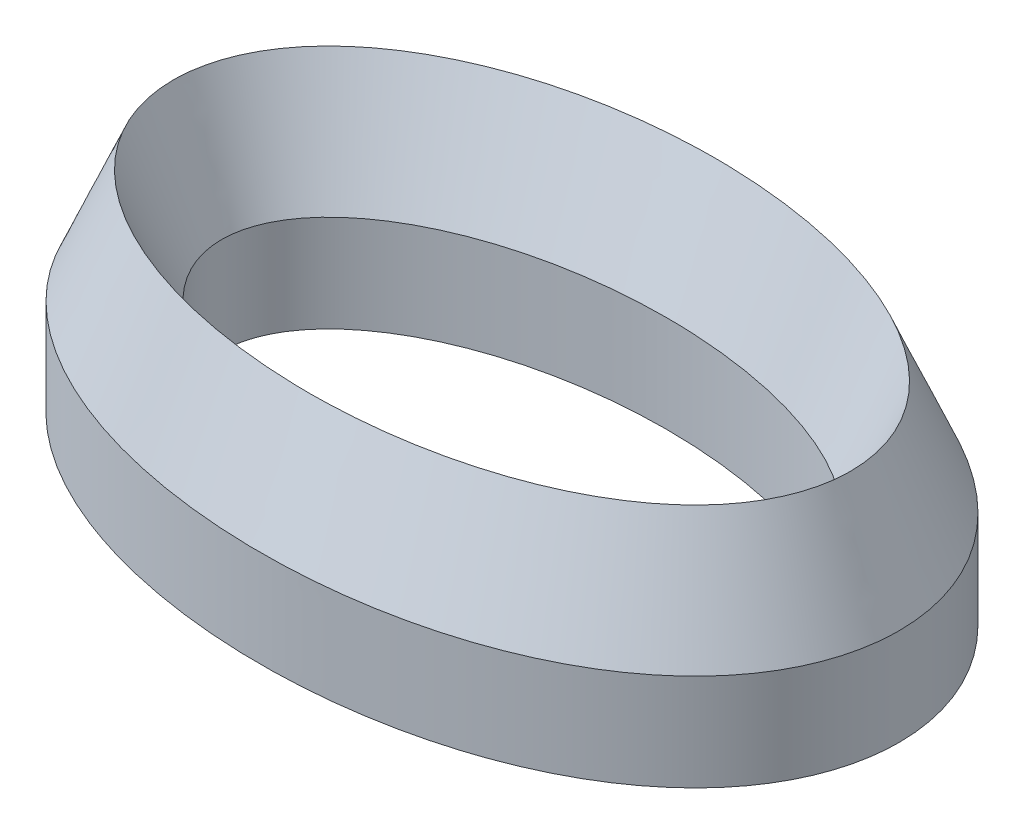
ISO-10303-21;
HEADER;
FILE_DESCRIPTION(('STEP AP214'),'2;1');
FILE_NAME('part.step','',(''),(''),'','','');
FILE_SCHEMA(('AUTOMOTIVE_DESIGN { 1 0 10303 214 1 1 1 1 }'));
ENDSEC;
DATA;
#1=APPLICATION_CONTEXT('core data for automotive mechanical design processes');
#2=APPLICATION_PROTOCOL_DEFINITION('international standard','automotive_design',2000,#1);
#3=PRODUCT_CONTEXT('',#1,'mechanical');
#4=PRODUCT('Part','Part','',(#3));
#5=PRODUCT_RELATED_PRODUCT_CATEGORY('part','',(#4));
#6=PRODUCT_DEFINITION_FORMATION('','',#4);
#7=PRODUCT_DEFINITION_CONTEXT('part definition',#1,'design');
#8=PRODUCT_DEFINITION('design','',#6,#7);
#9=PRODUCT_DEFINITION_SHAPE('','',#8);
#10=(LENGTH_UNIT() NAMED_UNIT(*) SI_UNIT(.MILLI.,.METRE.));
#11=(NAMED_UNIT(*) PLANE_ANGLE_UNIT() SI_UNIT($,.RADIAN.));
#12=(NAMED_UNIT(*) SI_UNIT($,.STERADIAN.) SOLID_ANGLE_UNIT());
#13=UNCERTAINTY_MEASURE_WITH_UNIT(LENGTH_MEASURE(1.E-05),#10,'distance_accuracy_value','');
#14=(GEOMETRIC_REPRESENTATION_CONTEXT(3) GLOBAL_UNCERTAINTY_ASSIGNED_CONTEXT((#13)) GLOBAL_UNIT_ASSIGNED_CONTEXT((#10,
#11,#12)) REPRESENTATION_CONTEXT('',''));
#15=CARTESIAN_POINT('',(0.,0.,0.));
#16=DIRECTION('',(0.,0.,1.));
#17=DIRECTION('',(1.,0.,0.));
#18=AXIS2_PLACEMENT_3D('',#15,#16,#17);
#19=CARTESIAN_POINT('',(-30.,0.,0.));
#20=CARTESIAN_POINT('',(-29.9999999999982,0.,0.523598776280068));
#21=CARTESIAN_POINT('',(-29.9517699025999,0.,1.04719674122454));
#22=CARTESIAN_POINT('',(-29.7593136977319,0.,2.0893517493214));
#23=CARTESIAN_POINT('',(-29.6150878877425,0.,2.6079071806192));
#24=CARTESIAN_POINT('',(-29.2320289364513,0.,3.6349831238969));
#25=CARTESIAN_POINT('',(-28.993196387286,0.,4.14350204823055));
#26=CARTESIAN_POINT('',(-28.4232237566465,0.,5.14560762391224));
#27=CARTESIAN_POINT('',(-28.0920845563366,0.,5.63919272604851));
#28=CARTESIAN_POINT('',(-26.9649888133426,0.,7.09041930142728));
#29=CARTESIAN_POINT('',(-26.0349479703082,0.,8.01841078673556));
#30=CARTESIAN_POINT('',(-23.8532287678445,0.,9.75983666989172));
#31=CARTESIAN_POINT('',(-22.6016043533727,0.,10.5732280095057));
#32=CARTESIAN_POINT('',(-19.8248025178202,0.,12.0541889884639));
#33=CARTESIAN_POINT('',(-18.2996937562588,0.,12.721722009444));
#34=CARTESIAN_POINT('',(-15.0345202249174,0.,13.8853055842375));
#35=CARTESIAN_POINT('',(-13.2945361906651,0.,14.3813273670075));
#36=CARTESIAN_POINT('',(-7.85243653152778,0.,15.5835628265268));
#37=CARTESIAN_POINT('',(-3.92699081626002,0.,16.));
#38=CARTESIAN_POINT('',(3.92699081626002,0.,16.));
#39=CARTESIAN_POINT('',(7.85243653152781,0.,15.5835628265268));
#40=CARTESIAN_POINT('',(13.2945361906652,0.,14.3813273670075));
#41=CARTESIAN_POINT('',(15.0345202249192,0.,13.8853055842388));
#42=CARTESIAN_POINT('',(18.2996937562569,0.,12.7217220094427));
#43=CARTESIAN_POINT('',(19.8248025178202,0.,12.0541889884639));
#44=CARTESIAN_POINT('',(22.6016043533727,0.,10.5732280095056));
#45=CARTESIAN_POINT('',(23.8532287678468,0.,9.75983666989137));
#46=CARTESIAN_POINT('',(26.0349479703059,0.,8.01841078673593));
#47=CARTESIAN_POINT('',(26.9649888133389,0.,7.09041930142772));
#48=CARTESIAN_POINT('',(28.0920845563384,0.,5.63919272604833));
#49=CARTESIAN_POINT('',(28.4232237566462,0.,5.14560762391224));
#50=CARTESIAN_POINT('',(28.9931963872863,0.,4.14350204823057));
#51=CARTESIAN_POINT('',(29.2320289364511,0.,3.63498312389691));
#52=CARTESIAN_POINT('',(29.6150878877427,0.,2.60790718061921));
#53=CARTESIAN_POINT('',(29.7593136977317,0.,2.08935174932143));
#54=CARTESIAN_POINT('',(29.9517699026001,0.,1.04719674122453));
#55=CARTESIAN_POINT('',(30.,0.,0.523598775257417));
#56=CARTESIAN_POINT('',(30.,0.,-0.523598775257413));
#57=CARTESIAN_POINT('',(29.9517699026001,0.,-1.04719674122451));
#58=CARTESIAN_POINT('',(29.7593136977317,0.,-2.08935174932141));
#59=CARTESIAN_POINT('',(29.6150878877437,0.,-2.60790718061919));
#60=CARTESIAN_POINT('',(29.2320289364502,0.,-3.63498312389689));
#61=CARTESIAN_POINT('',(28.9931963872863,0.,-4.14350204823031));
#62=CARTESIAN_POINT('',(28.4232237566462,0.,-5.14560762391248));
#63=CARTESIAN_POINT('',(28.0920845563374,0.,-5.63919272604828));
#64=CARTESIAN_POINT('',(26.9649888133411,0.,-7.09041930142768));
#65=CARTESIAN_POINT('',(26.0349479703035,0.,-8.01841078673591));
#66=CARTESIAN_POINT('',(23.8532287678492,0.,-9.75983666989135));
#67=CARTESIAN_POINT('',(22.6016043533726,0.,-10.5732280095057));
#68=CARTESIAN_POINT('',(19.8248025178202,0.,-12.0541889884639));
#69=CARTESIAN_POINT('',(18.299693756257,0.,-12.7217220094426));
#70=CARTESIAN_POINT('',(15.0345202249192,0.,-13.8853055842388));
#71=CARTESIAN_POINT('',(13.2945361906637,0.,-14.3813273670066));
#72=CARTESIAN_POINT('',(7.85243653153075,0.,-15.5835628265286));
#73=CARTESIAN_POINT('',(3.92699081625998,0.,-16.));
#74=CARTESIAN_POINT('',(-3.92699081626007,0.,-16.));
#75=CARTESIAN_POINT('',(-7.85243653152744,0.,-15.5835628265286));
#76=CARTESIAN_POINT('',(-13.2945361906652,0.,-14.3813273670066));
#77=CARTESIAN_POINT('',(-15.0345202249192,0.,-13.8853055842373));
#78=CARTESIAN_POINT('',(-18.2996937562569,0.,-12.7217220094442));
#79=CARTESIAN_POINT('',(-19.8248025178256,0.,-12.0541889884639));
#80=CARTESIAN_POINT('',(-22.6016043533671,0.,-10.5732280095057));
#81=CARTESIAN_POINT('',(-23.8532287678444,0.,-9.75983666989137));
#82=CARTESIAN_POINT('',(-26.0349479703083,0.,-8.01841078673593));
#83=CARTESIAN_POINT('',(-26.9649888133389,0.,-7.09041930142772));
#84=CARTESIAN_POINT('',(-28.0920845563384,0.,-5.63919272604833));
#85=CARTESIAN_POINT('',(-28.4232237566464,0.,-5.14560762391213));
#86=CARTESIAN_POINT('',(-28.9931963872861,0.,-4.1435020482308));
#87=CARTESIAN_POINT('',(-29.2320289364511,0.,-3.63498312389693));
#88=CARTESIAN_POINT('',(-29.6150878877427,0.,-2.60790718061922));
#89=CARTESIAN_POINT('',(-29.7593136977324,0.,-2.08935174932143));
#90=CARTESIAN_POINT('',(-29.9517699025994,0.,-1.04719674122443));
#91=CARTESIAN_POINT('',(-30.0000000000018,0.,-0.523598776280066));
#92=CARTESIAN_POINT('',(-30.,0.,0.));
#93=CARTESIAN_POINT('',(-40.1873955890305,24.,0.));
#94=CARTESIAN_POINT('',(-40.1873955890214,24.,1.14868954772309));
#95=CARTESIAN_POINT('',(-40.0806111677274,24.,2.29704397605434));
#96=CARTESIAN_POINT('',(-39.66647867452,24.,4.53958146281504));
#97=CARTESIAN_POINT('',(-39.3595777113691,24.,5.63336317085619));
#98=CARTESIAN_POINT('',(-38.5778192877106,24.,7.72945117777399));
#99=CARTESIAN_POINT('',(-38.1034284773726,24.,8.73182512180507));
#100=CARTESIAN_POINT('',(-37.0234731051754,24.,10.6305641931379));
#101=CARTESIAN_POINT('',(-36.4181176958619,24.,11.5272203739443));
#102=CARTESIAN_POINT('',(-34.4504335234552,24.,14.0607722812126));
#103=CARTESIAN_POINT('',(-32.9401892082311,24.,15.5414374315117));
#104=CARTESIAN_POINT('',(-29.6584336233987,24.,18.1609010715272));
#105=CARTESIAN_POINT('',(-27.8842437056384,24.,19.3015353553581));
#106=CARTESIAN_POINT('',(-24.1303001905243,24.,21.30363856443));
#107=CARTESIAN_POINT('',(-22.1493664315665,24.,22.16478085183));
#108=CARTESIAN_POINT('',(-18.0243374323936,24.,23.6347841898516));
#109=CARTESIAN_POINT('',(-15.8799701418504,24.,24.2431910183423));
#110=CARTESIAN_POINT('',(-9.27422618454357,24.,25.7024916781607));
#111=CARTESIAN_POINT('',(-4.63820519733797,24.,26.1873955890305));
#112=CARTESIAN_POINT('',(4.63820519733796,24.,26.1873955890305));
#113=CARTESIAN_POINT('',(9.27422618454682,24.,25.7024916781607));
#114=CARTESIAN_POINT('',(15.8799701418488,24.,24.2431910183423));
#115=CARTESIAN_POINT('',(18.0243374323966,24.,23.6347841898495));
#116=CARTESIAN_POINT('',(22.1493664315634,24.,22.1647808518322));
#117=CARTESIAN_POINT('',(24.1303001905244,24.,21.3036385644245));
#118=CARTESIAN_POINT('',(27.8842437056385,24.,19.3015353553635));
#119=CARTESIAN_POINT('',(29.6584336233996,24.,18.1609010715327));
#120=CARTESIAN_POINT('',(32.9401892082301,24.,15.5414374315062));
#121=CARTESIAN_POINT('',(34.4504335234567,24.,14.0607722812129));
#122=CARTESIAN_POINT('',(36.4181176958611,24.,11.5272203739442));
#123=CARTESIAN_POINT('',(37.0234731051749,24.,10.6305641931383));
#124=CARTESIAN_POINT('',(38.1034284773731,24.,8.73182512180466));
#125=CARTESIAN_POINT('',(38.5778192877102,24.,7.72945117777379));
#126=CARTESIAN_POINT('',(39.3595777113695,24.,5.63336317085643));
#127=CARTESIAN_POINT('',(39.6664786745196,24.,4.53958146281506));
#128=CARTESIAN_POINT('',(40.0806111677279,24.,2.29704397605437));
#129=CARTESIAN_POINT('',(40.1873955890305,24.,1.14868953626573));
#130=CARTESIAN_POINT('',(40.1873955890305,24.,-1.14868953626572));
#131=CARTESIAN_POINT('',(40.0806111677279,24.,-2.29704397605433));
#132=CARTESIAN_POINT('',(39.6664786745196,24.,-4.53958146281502));
#133=CARTESIAN_POINT('',(39.3595777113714,24.,-5.6333631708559));
#134=CARTESIAN_POINT('',(38.5778192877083,24.,-7.72945117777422));
#135=CARTESIAN_POINT('',(38.1034284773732,24.,-8.73182512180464));
#136=CARTESIAN_POINT('',(37.0234731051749,24.,-10.6305641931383));
#137=CARTESIAN_POINT('',(36.4181176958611,24.,-11.527220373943));
#138=CARTESIAN_POINT('',(34.4504335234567,24.,-14.060772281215));
#139=CARTESIAN_POINT('',(32.9401892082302,24.,-15.5414374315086));
#140=CARTESIAN_POINT('',(29.6584336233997,24.,-18.1609010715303));
#141=CARTESIAN_POINT('',(27.8842437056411,24.,-19.3015353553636));
#142=CARTESIAN_POINT('',(24.1303001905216,24.,-21.3036385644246));
#143=CARTESIAN_POINT('',(22.1493664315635,24.,-22.1647808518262));
#144=CARTESIAN_POINT('',(18.0243374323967,24.,-23.6347841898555));
#145=CARTESIAN_POINT('',(15.8799701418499,24.,-24.2431910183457));
#146=CARTESIAN_POINT('',(9.27422618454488,24.,-25.702491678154));
#147=CARTESIAN_POINT('',(4.63820519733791,24.,-26.1873955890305));
#148=CARTESIAN_POINT('',(-4.63820519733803,24.,-26.1873955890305));
#149=CARTESIAN_POINT('',(-9.27422618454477,24.,-25.7024916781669));
#150=CARTESIAN_POINT('',(-15.8799701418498,24.,-24.2431910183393));
#151=CARTESIAN_POINT('',(-18.0243374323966,24.,-23.6347841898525));
#152=CARTESIAN_POINT('',(-22.1493664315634,24.,-22.1647808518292));
#153=CARTESIAN_POINT('',(-24.1303001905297,24.,-21.3036385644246));
#154=CARTESIAN_POINT('',(-27.8842437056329,24.,-19.3015353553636));
#155=CARTESIAN_POINT('',(-29.6584336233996,24.,-18.1609010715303));
#156=CARTESIAN_POINT('',(-32.9401892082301,24.,-15.5414374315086));
#157=CARTESIAN_POINT('',(-34.4504335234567,24.,-14.0607722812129));
#158=CARTESIAN_POINT('',(-36.4181176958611,24.,-11.5272203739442));
#159=CARTESIAN_POINT('',(-37.023473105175,24.,-10.6305641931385));
#160=CARTESIAN_POINT('',(-38.1034284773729,24.,-8.73182512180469));
#161=CARTESIAN_POINT('',(-38.5778192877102,24.,-7.72945117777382));
#162=CARTESIAN_POINT('',(-39.3595777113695,24.,-5.63336317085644));
#163=CARTESIAN_POINT('',(-39.666478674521,24.,-4.53958146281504));
#164=CARTESIAN_POINT('',(-40.0806111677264,24.,-2.29704397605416));
#165=CARTESIAN_POINT('',(-40.1873955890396,24.,-1.14868954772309));
#166=CARTESIAN_POINT('',(-40.1873955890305,24.,0.));
#167=B_SPLINE_SURFACE_WITH_KNOTS('',1,3,((#19,#20,#21,#22,#23,#24,#25,#26,#27,#28,#29,#30,#31,
#32,#33,#34,#35,#36,#37,#38,#39,#40,#41,#42,#43,#44,#45,#46,#47,#48,#49,#50,#51,#52,#53,#54,#55,
#56,#57,#58,#59,#60,#61,#62,#63,#64,#65,#66,#67,#68,#69,#70,#71,#72,#73,#74,#75,#76,#77,#78,#79,
#80,#81,#82,#83,#84,#85,#86,#87,#88,#89,#90,#91,#92),(#93,#94,#95,#96,#97,#98,#99,#100,#101,
#102,#103,#104,#105,#106,#107,#108,#109,#110,#111,#112,#113,#114,#115,#116,#117,#118,#119,#120,
#121,#122,#123,#124,#125,#126,#127,#128,#129,#130,#131,#132,#133,#134,#135,#136,#137,#138,#139,
#140,#141,#142,#143,#144,#145,#146,#147,#148,#149,#150,#151,#152,#153,#154,#155,#156,#157,#158,
#159,#160,#161,#162,#163,#164,#165,#166)),.UNSPECIFIED.,.F.,.T.,.F.,(2,2),(4,2,2,2,2,2,2,2,2,2,
2,2,2,2,2,2,2,2,2,2,2,2,2,2,2,2,2,2,2,2,2,2,2,2,2,2,4),(0.,1.),(0.,0.098174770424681,
0.196349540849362,0.294524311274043,0.392699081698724,0.589048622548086,0.785398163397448,
0.98174770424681,1.17809724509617,1.5707963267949,1.96349540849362,2.15984494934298,
2.35619449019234,2.55254403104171,2.74889357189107,2.84706834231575,2.94524311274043,
3.04341788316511,3.14159265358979,3.23976742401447,3.33794219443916,3.43611696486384,
3.53429173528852,3.73064127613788,3.92699081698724,4.1233403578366,4.31968989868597,
4.71238898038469,5.10508806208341,5.30143760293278,5.49778714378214,5.6941366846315,
5.89048622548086,5.98866099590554,6.08683576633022,6.18501053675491,6.28318530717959),.UNSPECIFIED.);
#168=CARTESIAN_POINT('',(0.,0.,0.));
#169=DIRECTION('',(0.,1.,0.));
#170=DIRECTION('',(-1.,0.,0.));
#171=AXIS2_PLACEMENT_3D('',#168,#169,#170);
#172=ELLIPSE('',#171,30.,16.);
#173=CARTESIAN_POINT('',(-30.,0.,0.));
#174=VERTEX_POINT('',#173);
#175=EDGE_CURVE('E64',#174,#174,#172,.T.);
#176=CARTESIAN_POINT('',(35.,11.7792618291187,0.));
#177=CARTESIAN_POINT('',(35.0000113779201,11.7792886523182,-0.196701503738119));
#178=CARTESIAN_POINT('',(34.9957297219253,11.7793764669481,-0.393410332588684));
#179=CARTESIAN_POINT('',(34.9786085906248,11.7795413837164,-0.786463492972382));
#180=CARTESIAN_POINT('',(34.9657685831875,11.7796184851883,-0.982807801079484));
#181=CARTESIAN_POINT('',(34.9315559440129,11.7796380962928,-1.37479398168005));
#182=CARTESIAN_POINT('',(34.9101815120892,11.779580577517,-1.57043569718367));
#183=CARTESIAN_POINT('',(34.8590142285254,11.7794086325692,-1.96061072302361));
#184=CARTESIAN_POINT('',(34.8292214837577,11.7792942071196,-2.15514404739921));
#185=CARTESIAN_POINT('',(34.7613513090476,11.779242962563,-2.54292416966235));
#186=CARTESIAN_POINT('',(34.723267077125,11.779306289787,-2.73616977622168));
#187=CARTESIAN_POINT('',(34.638955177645,11.7794233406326,-3.1208766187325));
#188=CARTESIAN_POINT('',(34.59272745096,11.7794770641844,-3.31233784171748));
#189=CARTESIAN_POINT('',(34.4923213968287,11.7795079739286,-3.69314869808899));
#190=CARTESIAN_POINT('',(34.4381435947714,11.7794851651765,-3.88249847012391));
#191=CARTESIAN_POINT('',(34.3220603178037,11.7793832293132,-4.2588126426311));
#192=CARTESIAN_POINT('',(34.2601548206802,11.7793041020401,-4.44577703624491));
#193=CARTESIAN_POINT('',(34.1296921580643,11.7792555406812,-4.81478016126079));
#194=CARTESIAN_POINT('',(34.0612262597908,11.7792847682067,-4.99685119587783));
#195=CARTESIAN_POINT('',(33.9172528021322,11.7793687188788,-5.35818417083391));
#196=CARTESIAN_POINT('',(33.8417452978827,11.7794234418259,-5.53744613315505));
#197=CARTESIAN_POINT('',(33.6839369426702,11.7794714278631,-5.89294321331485));
#198=CARTESIAN_POINT('',(33.6016363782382,11.7794646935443,-6.06917845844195));
#199=CARTESIAN_POINT('',(33.4305201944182,11.779396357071,-6.41845609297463));
#200=CARTESIAN_POINT('',(33.341704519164,11.779334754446,-6.5914984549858));
#201=CARTESIAN_POINT('',(33.1578733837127,11.779268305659,-6.93425055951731));
#202=CARTESIAN_POINT('',(33.0628580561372,11.7792634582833,-7.1039603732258));
#203=CARTESIAN_POINT('',(32.8669072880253,11.7792813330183,-7.43992095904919));
#204=CARTESIAN_POINT('',(32.7659719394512,11.7793040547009,-7.6061717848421));
#205=CARTESIAN_POINT('',(32.558441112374,11.7793298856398,-7.93512795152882));
#206=CARTESIAN_POINT('',(32.4518449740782,11.7793329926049,-8.09783287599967));
#207=CARTESIAN_POINT('',(32.2332901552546,11.779322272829,-8.41960464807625));
#208=CARTESIAN_POINT('',(32.12133122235,11.7793084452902,-8.57867132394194));
#209=CARTESIAN_POINT('',(31.8332167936,11.7792652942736,-8.97428104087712));
#210=CARTESIAN_POINT('',(31.6537587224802,11.7792316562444,-9.20842729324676));
#211=CARTESIAN_POINT('',(31.2842435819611,11.7793890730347,-9.66821094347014));
#212=CARTESIAN_POINT('',(31.094185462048,11.7795801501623,-9.89384749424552));
#213=CARTESIAN_POINT('',(30.7041746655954,11.779907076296,-10.336536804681));
#214=CARTESIAN_POINT('',(30.5042186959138,11.7800429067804,-10.5535866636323));
#215=CARTESIAN_POINT('',(30.0953289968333,11.7801857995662,-10.9789997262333));
#216=CARTESIAN_POINT('',(29.8863955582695,11.780192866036,-11.1873632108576));
#217=CARTESIAN_POINT('',(29.2463713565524,11.7800050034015,-11.8004849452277));
#218=CARTESIAN_POINT('',(28.8028283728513,11.7796001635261,-12.1924061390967));
#219=CARTESIAN_POINT('',(28.2318980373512,11.779332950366,-12.6617193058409));
#220=CARTESIAN_POINT('',(28.116866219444,11.7792914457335,-12.7545687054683));
#221=CARTESIAN_POINT('',(27.8852142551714,11.779249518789,-12.9382617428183));
#222=CARTESIAN_POINT('',(27.7685942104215,11.7792490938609,-13.0291055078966));
#223=CARTESIAN_POINT('',(27.4164331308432,11.7792285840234,-13.2986328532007));
#224=CARTESIAN_POINT('',(27.1785884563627,11.7791892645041,-13.474314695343));
#225=CARTESIAN_POINT('',(26.686170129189,11.7791147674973,-13.8258411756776));
#226=CARTESIAN_POINT('',(26.4313323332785,11.7790798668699,-14.001315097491));
#227=CARTESIAN_POINT('',(25.9161474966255,11.7790624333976,-14.3439769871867));
#228=CARTESIAN_POINT('',(25.6558003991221,11.7790799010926,-14.5111648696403));
#229=CARTESIAN_POINT('',(25.1300054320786,11.7791480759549,-14.8375805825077));
#230=CARTESIAN_POINT('',(24.8645553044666,11.7791987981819,-14.9968047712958));
#231=CARTESIAN_POINT('',(24.3291389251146,11.7792717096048,-15.3074593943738));
#232=CARTESIAN_POINT('',(24.0591726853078,11.779293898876,-15.4588898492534));
#233=CARTESIAN_POINT('',(23.5151197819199,11.7792805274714,-15.754243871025));
#234=CARTESIAN_POINT('',(23.241032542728,11.7792449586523,-15.8981663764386));
#235=CARTESIAN_POINT('',(22.689171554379,11.7792666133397,-16.1787528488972));
#236=CARTESIAN_POINT('',(22.4113978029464,11.7793238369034,-16.3154168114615));
#237=CARTESIAN_POINT('',(21.85205695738,11.7794432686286,-16.5818802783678));
#238=CARTESIAN_POINT('',(21.5704847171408,11.7795054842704,-16.7116689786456));
#239=CARTESIAN_POINT('',(21.0042741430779,11.7795932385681,-16.9643516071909));
#240=CARTESIAN_POINT('',(20.7196358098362,11.7796187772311,-17.0872455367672));
#241=CARTESIAN_POINT('',(19.8616692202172,11.7796081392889,-17.4458342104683));
#242=CARTESIAN_POINT('',(19.2841159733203,11.7794847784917,-17.6715180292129));
#243=CARTESIAN_POINT('',(18.4109664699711,11.7793306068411,-17.9912178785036));
#244=CARTESIAN_POINT('',(18.118760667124,11.779284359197,-18.0946530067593));
#245=CARTESIAN_POINT('',(17.5322513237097,11.7792400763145,-18.2954304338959));
#246=CARTESIAN_POINT('',(17.2379477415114,11.7792420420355,-18.3927726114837));
#247=CARTESIAN_POINT('',(16.465310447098,11.7792438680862,-18.6397072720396));
#248=CARTESIAN_POINT('',(15.9854348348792,11.7792416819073,-18.7844937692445));
#249=CARTESIAN_POINT('',(15.0214194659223,11.7792553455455,-19.0591064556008));
#250=CARTESIAN_POINT('',(14.5372795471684,11.7792711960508,-19.1889320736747));
#251=CARTESIAN_POINT('',(13.5651281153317,11.7792815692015,-19.4341983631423));
#252=CARTESIAN_POINT('',(13.0771149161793,11.7792760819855,-19.549632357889));
#253=CARTESIAN_POINT('',(12.342790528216,11.7792684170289,-19.7122690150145));
#254=CARTESIAN_POINT('',(12.0976310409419,11.7792659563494,-19.7647289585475));
#255=CARTESIAN_POINT('',(11.6065977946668,11.7793116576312,-19.8662084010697));
#256=CARTESIAN_POINT('',(11.3607240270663,11.7793598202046,-19.9152278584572));
#257=CARTESIAN_POINT('',(10.6220184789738,11.7795238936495,-20.0572073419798));
#258=CARTESIAN_POINT('',(10.1281975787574,11.7796593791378,-20.1450674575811));
#259=CARTESIAN_POINT('',(9.13838282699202,11.7798414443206,-20.3074904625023));
#260=CARTESIAN_POINT('',(8.64238896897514,11.7798880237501,-20.3820533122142));
#261=CARTESIAN_POINT('',(7.64737856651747,11.7798770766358,-20.5183460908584));
#262=CARTESIAN_POINT('',(7.14835756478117,11.7798192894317,-20.5800434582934));
#263=CARTESIAN_POINT('',(6.14890566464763,11.7797659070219,-20.690676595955));
#264=CARTESIAN_POINT('',(5.64847476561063,11.7797703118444,-20.7396123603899));
#265=CARTESIAN_POINT('',(4.64668097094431,11.7797880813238,-20.8248643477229));
#266=CARTESIAN_POINT('',(4.14531837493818,11.7798014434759,-20.8611840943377));
#267=CARTESIAN_POINT('',(3.14184468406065,11.7797411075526,-20.9212991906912));
#268=CARTESIAN_POINT('',(2.63973359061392,11.7796674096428,-20.9450945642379));
#269=CARTESIAN_POINT('',(1.63511158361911,11.7794771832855,-20.9802425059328));
#270=CARTESIAN_POINT('',(1.13260070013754,11.7793606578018,-20.9915959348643));
#271=CARTESIAN_POINT('',(0.127450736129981,11.7792448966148,-21.0019281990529));
#272=CARTESIAN_POINT('',(-0.375188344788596,11.7792456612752,-21.000906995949));
#273=CARTESIAN_POINT('',(-1.40106746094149,11.779241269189,-20.986142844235));
#274=CARTESIAN_POINT('',(-1.92430005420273,11.7792358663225,-20.9718756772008));
#275=CARTESIAN_POINT('',(-2.9702252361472,11.7793077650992,-20.9298975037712));
#276=CARTESIAN_POINT('',(-3.49291782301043,11.7793850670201,-20.9021864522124));
#277=CARTESIAN_POINT('',(-4.5374862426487,11.7795762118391,-20.8332099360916));
#278=CARTESIAN_POINT('',(-5.05936195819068,11.7796900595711,-20.7919426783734));
#279=CARTESIAN_POINT('',(-5.8412087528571,11.7797566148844,-20.7197094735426));
#280=CARTESIAN_POINT('',(-6.10166590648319,11.7797614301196,-20.6939093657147));
#281=CARTESIAN_POINT('',(-6.62221546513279,11.7797890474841,-20.6388605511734));
#282=CARTESIAN_POINT('',(-6.88230787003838,11.7798118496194,-20.6096118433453));
#283=CARTESIAN_POINT('',(-7.66219657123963,11.7798674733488,-20.5166051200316));
#284=CARTESIAN_POINT('',(-8.18137875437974,11.7798874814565,-20.4476072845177));
#285=CARTESIAN_POINT('',(-9.21764089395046,11.779817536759,-20.2953223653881));
#286=CARTESIAN_POINT('',(-9.73472084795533,11.7797275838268,-20.212035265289));
#287=CARTESIAN_POINT('',(-10.7640544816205,11.7794830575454,-20.0312203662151));
#288=CARTESIAN_POINT('',(-11.2763193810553,11.7793287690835,-19.9337565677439));
#289=CARTESIAN_POINT('',(-12.297803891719,11.7792588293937,-19.723983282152));
#290=CARTESIAN_POINT('',(-12.8070235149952,11.7793431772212,-19.6116738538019));
#291=CARTESIAN_POINT('',(-13.8216478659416,11.7795029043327,-19.3717297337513));
#292=CARTESIAN_POINT('',(-14.3270539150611,11.7795782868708,-19.244100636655));
#293=CARTESIAN_POINT('',(-15.3335896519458,11.7795880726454,-18.9728649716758));
#294=CARTESIAN_POINT('',(-15.8347192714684,11.7795224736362,-18.8292581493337));
#295=CARTESIAN_POINT('',(-16.5824089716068,11.7793895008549,-18.601484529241));
#296=CARTESIAN_POINT('',(-16.8308757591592,11.7793394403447,-18.5235320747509));
#297=CARTESIAN_POINT('',(-17.3264509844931,11.7792756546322,-18.3634204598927));
#298=CARTESIAN_POINT('',(-17.5735594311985,11.7792619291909,-18.2812613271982));
#299=CARTESIAN_POINT('',(-18.0662908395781,11.7792637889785,-18.1126431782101));
#300=CARTESIAN_POINT('',(-18.3119138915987,11.7792793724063,-18.026184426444));
#301=CARTESIAN_POINT('',(-18.8015585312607,11.7792889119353,-17.8488509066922));
#302=CARTESIAN_POINT('',(-19.0455800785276,11.7792828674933,-17.7579760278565));
#303=CARTESIAN_POINT('',(-19.9419227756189,11.7792411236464,-17.4146521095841));
#304=CARTESIAN_POINT('',(-20.5889695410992,11.7791726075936,-17.1481140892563));
#305=CARTESIAN_POINT('',(-21.5478068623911,11.7791281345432,-16.7221976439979));
#306=CARTESIAN_POINT('',(-21.8654601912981,11.7791230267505,-16.5758757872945));
#307=CARTESIAN_POINT('',(-22.3387153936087,11.7791732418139,-16.349631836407));
#308=CARTESIAN_POINT('',(-22.4959323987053,11.7791996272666,-16.2730889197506));
#309=CARTESIAN_POINT('',(-22.8092210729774,11.7792311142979,-16.1176947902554));
#310=CARTESIAN_POINT('',(-22.9652927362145,11.7792362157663,-16.0388435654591));
#311=CARTESIAN_POINT('',(-23.4322344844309,11.7792951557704,-15.7985288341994));
#312=CARTESIAN_POINT('',(-23.7413085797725,11.7793927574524,-15.6335537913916));
#313=CARTESIAN_POINT('',(-24.3540739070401,11.7796154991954,-15.2938942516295));
#314=CARTESIAN_POINT('',(-24.6577651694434,11.7797406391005,-15.1192098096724));
#315=CARTESIAN_POINT('',(-25.2590959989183,11.7798853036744,-14.7596603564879));
#316=CARTESIAN_POINT('',(-25.5567352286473,11.7799048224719,-14.5747947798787));
#317=CARTESIAN_POINT('',(-26.1451936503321,11.77980000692,-14.1944995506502));
#318=CARTESIAN_POINT('',(-26.436012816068,11.7796756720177,-13.9990698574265));
#319=CARTESIAN_POINT('',(-27.0144710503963,11.7794205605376,-13.5942361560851));
#320=CARTESIAN_POINT('',(-27.3019925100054,11.7792897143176,-13.3846635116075));
#321=CARTESIAN_POINT('',(-27.7267172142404,11.7792500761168,-13.0617042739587));
#322=CARTESIAN_POINT('',(-27.8672036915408,11.7792629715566,-12.9526141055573));
#323=CARTESIAN_POINT('',(-28.1458469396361,11.7792392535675,-12.7314927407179));
#324=CARTESIAN_POINT('',(-28.284003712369,11.7792026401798,-12.6194615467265));
#325=CARTESIAN_POINT('',(-28.5578942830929,11.7791259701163,-12.3923958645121));
#326=CARTESIAN_POINT('',(-28.6936273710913,11.7790859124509,-12.2773605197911));
#327=CARTESIAN_POINT('',(-28.9624836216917,11.7790271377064,-12.0442780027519));
#328=CARTESIAN_POINT('',(-29.0956067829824,11.779008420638,-11.9262308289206));
#329=CARTESIAN_POINT('',(-29.3590853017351,11.7790003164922,-11.6870865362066));
#330=CARTESIAN_POINT('',(-29.4894406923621,11.7790109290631,-11.5659894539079));
#331=CARTESIAN_POINT('',(-29.74720070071,11.779016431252,-11.3207002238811));
#332=CARTESIAN_POINT('',(-29.8746053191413,11.7790113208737,-11.1965080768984));
#333=CARTESIAN_POINT('',(-30.2512175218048,11.7790367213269,-10.8201998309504));
#334=CARTESIAN_POINT('',(-30.4958287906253,11.7791076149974,-10.5634419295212));
#335=CARTESIAN_POINT('',(-30.97122658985,11.7792119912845,-10.037410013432));
#336=CARTESIAN_POINT('',(-31.2020123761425,11.7792454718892,-9.76813532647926));
#337=CARTESIAN_POINT('',(-31.6481137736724,11.779267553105,-9.21733988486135));
#338=CARTESIAN_POINT('',(-31.8634410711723,11.7792561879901,-8.93582864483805));
#339=CARTESIAN_POINT('',(-32.1736405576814,11.7792652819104,-8.50445155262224));
#340=CARTESIAN_POINT('',(-32.2749035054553,11.7792726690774,-8.35914866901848));
#341=CARTESIAN_POINT('',(-32.4729612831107,11.779250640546,-8.0655136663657));
#342=CARTESIAN_POINT('',(-32.5697559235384,11.7792212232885,-7.91718141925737));
#343=CARTESIAN_POINT('',(-32.7747807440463,11.7792070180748,-7.59204446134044));
#344=CARTESIAN_POINT('',(-32.8821489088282,11.7792306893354,-7.41469513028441));
#345=CARTESIAN_POINT('',(-33.0901151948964,11.7792664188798,-7.05607036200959));
#346=CARTESIAN_POINT('',(-33.1907133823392,11.7792784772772,-6.87479496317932));
#347=CARTESIAN_POINT('',(-33.3847876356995,11.7793256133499,-6.50851154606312));
#348=CARTESIAN_POINT('',(-33.4782650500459,11.7793606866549,-6.32350424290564));
#349=CARTESIAN_POINT('',(-33.657765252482,11.7793866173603,-5.94990042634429));
#350=CARTESIAN_POINT('',(-33.7437878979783,11.7793774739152,-5.76130384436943));
#351=CARTESIAN_POINT('',(-33.9080185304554,11.7793256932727,-5.38080961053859));
#352=CARTESIAN_POINT('',(-33.9862291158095,11.7792830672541,-5.18891308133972));
#353=CARTESIAN_POINT('',(-34.1345584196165,11.7792577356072,-4.8020182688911));
#354=CARTESIAN_POINT('',(-34.2046771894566,11.7792750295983,-4.60702000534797));
#355=CARTESIAN_POINT('',(-34.3365236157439,11.7793129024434,-4.21418356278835));
#356=CARTESIAN_POINT('',(-34.3982507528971,11.7793334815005,-4.01634520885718));
#357=CARTESIAN_POINT('',(-34.4843529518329,11.7793445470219,-3.71772949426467));
#358=CARTESIAN_POINT('',(-34.5119730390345,11.779344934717,-3.61787803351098));
#359=CARTESIAN_POINT('',(-34.5650083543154,11.7793131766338,-3.41759130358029));
#360=CARTESIAN_POINT('',(-34.5904235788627,11.7792810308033,-3.31715603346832));
#361=CARTESIAN_POINT('',(-34.6636249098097,11.7792208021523,-3.0139197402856));
#362=CARTESIAN_POINT('',(-34.7080473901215,11.7792296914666,-2.8102948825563));
#363=CARTESIAN_POINT('',(-34.7876418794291,11.7792725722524,-2.40125083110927));
#364=CARTESIAN_POINT('',(-34.8228139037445,11.7793065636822,-2.19583164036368));
#365=CARTESIAN_POINT('',(-34.8837813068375,11.7794132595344,-1.7836034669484));
#366=CARTESIAN_POINT('',(-34.9095766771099,11.7794859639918,-1.57679448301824));
#367=CARTESIAN_POINT('',(-34.9516496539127,11.7795253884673,-1.16220984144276));
#368=CARTESIAN_POINT('',(-34.9679272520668,11.779492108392,-0.95443418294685));
#369=CARTESIAN_POINT('',(-34.9908912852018,11.7793751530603,-0.538381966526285));
#370=CARTESIAN_POINT('',(-34.9975790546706,11.779291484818,-0.330105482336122));
#371=CARTESIAN_POINT('',(-35.0013229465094,11.779243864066,0.086534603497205));
#372=CARTESIAN_POINT('',(-34.9983790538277,11.7792799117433,0.294898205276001));
#373=CARTESIAN_POINT('',(-34.9828780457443,11.7793524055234,0.711257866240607));
#374=CARTESIAN_POINT('',(-34.9703213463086,11.7793888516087,0.919253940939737));
#375=CARTESIAN_POINT('',(-34.9356621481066,11.7793701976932,1.33444644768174));
#376=CARTESIAN_POINT('',(-34.9135597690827,11.7793150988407,1.54164288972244));
#377=CARTESIAN_POINT('',(-34.8620801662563,11.7792602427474,1.93850867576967));
#378=CARTESIAN_POINT('',(-34.8334147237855,11.7792564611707,2.12827077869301));
#379=CARTESIAN_POINT('',(-34.7681684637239,11.7792790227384,2.50642578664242));
#380=CARTESIAN_POINT('',(-34.7315878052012,11.7793053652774,2.69481871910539));
#381=CARTESIAN_POINT('',(-34.6506966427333,11.7793861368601,3.06992065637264));
#382=CARTESIAN_POINT('',(-34.6063867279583,11.7794405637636,3.25662978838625));
#383=CARTESIAN_POINT('',(-34.510196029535,11.779479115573,3.62808783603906));
#384=CARTESIAN_POINT('',(-34.4583151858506,11.7794632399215,3.8128367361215));
#385=CARTESIAN_POINT('',(-34.3471931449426,11.7793843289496,4.18010608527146));
#386=CARTESIAN_POINT('',(-34.2879519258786,11.7793212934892,4.36262652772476));
#387=CARTESIAN_POINT('',(-34.1623397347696,11.779259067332,4.72519442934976));
#388=CARTESIAN_POINT('',(-34.0959687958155,11.7792598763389,4.90524189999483));
#389=CARTESIAN_POINT('',(-33.9563167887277,11.779273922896,5.26264372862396));
#390=CARTESIAN_POINT('',(-33.8830354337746,11.7792871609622,5.43999797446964));
#391=CARTESIAN_POINT('',(-33.7298218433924,11.7792879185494,5.79180794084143));
#392=CARTESIAN_POINT('',(-33.6498895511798,11.7792754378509,5.96626363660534));
#393=CARTESIAN_POINT('',(-33.479435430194,11.7792490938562,6.32087456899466));
#394=CARTESIAN_POINT('',(-33.3885822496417,11.7792351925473,6.50087068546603));
#395=CARTESIAN_POINT('',(-33.2001596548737,11.7792373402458,6.85729638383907));
#396=CARTESIAN_POINT('',(-33.1025901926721,11.7792533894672,7.03372594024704));
#397=CARTESIAN_POINT('',(-32.8002544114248,11.7793018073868,7.55745125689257));
#398=CARTESIAN_POINT('',(-32.5858294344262,11.7793344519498,7.8992483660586));
#399=CARTESIAN_POINT('',(-32.2469051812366,11.7793150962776,8.40014104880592));
#400=CARTESIAN_POINT('',(-32.1310222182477,11.779297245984,8.56517271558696));
#401=CARTESIAN_POINT('',(-31.8937952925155,11.7792755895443,8.89127575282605));
#402=CARTESIAN_POINT('',(-31.7724513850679,11.779271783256,9.05234716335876));
#403=CARTESIAN_POINT('',(-31.5246172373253,11.779251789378,9.37049818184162));
#404=CARTESIAN_POINT('',(-31.398126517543,11.7792356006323,9.52757741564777));
#405=CARTESIAN_POINT('',(-31.1402967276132,11.7791856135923,9.8377104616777));
#406=CARTESIAN_POINT('',(-31.0089574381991,11.7791518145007,9.99076409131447));
#407=CARTESIAN_POINT('',(-30.6551837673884,11.7790610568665,10.390626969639));
#408=CARTESIAN_POINT('',(-30.428826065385,11.7790032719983,10.633979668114));
#409=CARTESIAN_POINT('',(-29.9649355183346,11.7789898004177,11.1098048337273));
#410=CARTESIAN_POINT('',(-29.7274013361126,11.7790341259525,11.3422759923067));
#411=CARTESIAN_POINT('',(-29.2421692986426,11.77914259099,11.7965686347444));
#412=CARTESIAN_POINT('',(-28.9944670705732,11.7792067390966,12.0183854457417));
#413=CARTESIAN_POINT('',(-28.4900644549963,11.7792711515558,12.4514726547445));
#414=CARTESIAN_POINT('',(-28.2333643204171,11.7792714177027,12.6627433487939));
#415=CARTESIAN_POINT('',(-27.4499037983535,11.7792405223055,13.2822336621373));
#416=CARTESIAN_POINT('',(-26.9108828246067,11.7791775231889,13.6751127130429));
#417=CARTESIAN_POINT('',(-26.0829249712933,11.7791148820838,14.2351530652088));
#418=CARTESIAN_POINT('',(-25.803687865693,11.7790993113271,14.4169612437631));
#419=CARTESIAN_POINT('',(-25.2393155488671,11.7790997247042,14.771223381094));
#420=CARTESIAN_POINT('',(-24.9541803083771,11.7791157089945,14.9436772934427));
#421=CARTESIAN_POINT('',(-24.3554653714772,11.7791784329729,15.2930751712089));
#422=CARTESIAN_POINT('',(-24.041444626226,11.779227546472,15.4692617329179));
#423=CARTESIAN_POINT('',(-23.4079191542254,11.7792564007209,15.8114799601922));
#424=CARTESIAN_POINT('',(-23.0884143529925,11.7792361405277,15.9775114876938));
#425=CARTESIAN_POINT('',(-22.4443696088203,11.779330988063,16.2999131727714));
#426=CARTESIAN_POINT('',(-22.11982718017,11.7794461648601,16.4562783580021));
#427=CARTESIAN_POINT('',(-21.4663572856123,11.7796541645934,16.759543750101));
#428=CARTESIAN_POINT('',(-21.1374298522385,11.7797469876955,16.9064440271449));
#429=CARTESIAN_POINT('',(-20.4755772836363,11.7798160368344,17.191100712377));
#430=CARTESIAN_POINT('',(-20.1426514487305,11.779792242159,17.3288554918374));
#431=CARTESIAN_POINT('',(-19.4732802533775,11.7796616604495,17.5955231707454));
#432=CARTESIAN_POINT('',(-19.1368348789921,11.7795548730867,17.7244360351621));
#433=CARTESIAN_POINT('',(-18.4602192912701,11.7793610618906,17.973984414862));
#434=CARTESIAN_POINT('',(-18.1200435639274,11.7792740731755,18.0946049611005));
#435=CARTESIAN_POINT('',(-17.4368917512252,11.7792487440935,18.32762719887));
#436=CARTESIAN_POINT('',(-17.0939156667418,11.7793104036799,18.4400288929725));
#437=CARTESIAN_POINT('',(-16.4055279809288,11.7794272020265,18.6567698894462));
#438=CARTESIAN_POINT('',(-16.0601170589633,11.7794823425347,18.7611113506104));
#439=CARTESIAN_POINT('',(-15.3670354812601,11.7795524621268,18.9619717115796));
#440=CARTESIAN_POINT('',(-15.0193648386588,11.779567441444,19.0584906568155));
#441=CARTESIAN_POINT('',(-13.9732914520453,11.7795130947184,19.3366310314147));
#442=CARTESIAN_POINT('',(-13.2718386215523,11.7793444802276,19.5068324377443));
#443=CARTESIAN_POINT('',(-11.4980329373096,11.7792154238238,19.898882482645));
#444=CARTESIAN_POINT('',(-10.4214756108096,11.779407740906,20.1019186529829));
#445=CARTESIAN_POINT('',(-8.799155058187,11.7796394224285,20.3593181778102));
#446=CARTESIAN_POINT('',(-8.25698995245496,11.7797071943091,20.4372732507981));
#447=CARTESIAN_POINT('',(-7.17067271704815,11.7797665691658,20.5777815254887));
#448=CARTESIAN_POINT('',(-6.62652060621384,11.779758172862,20.6403348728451));
#449=CARTESIAN_POINT('',(-4.99148128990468,11.7797743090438,20.8054323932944));
#450=CARTESIAN_POINT('',(-3.89820318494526,11.7798401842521,20.8853838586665));
#451=CARTESIAN_POINT('',(-2.25612772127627,11.7796101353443,20.9608739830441));
#452=CARTESIAN_POINT('',(-1.70822555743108,11.7794785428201,20.9786296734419));
#453=CARTESIAN_POINT('',(-0.612121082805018,11.7792967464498,20.9994033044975));
#454=CARTESIAN_POINT('',(-0.0639187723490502,11.7792465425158,21.0024212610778));
#455=CARTESIAN_POINT('',(1.03219974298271,11.7793345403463,20.9937582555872));
#456=CARTESIAN_POINT('',(1.58011598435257,11.7794726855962,20.9820817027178));
#457=CARTESIAN_POINT('',(2.67543848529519,11.7796837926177,20.9439353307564));
#458=CARTESIAN_POINT('',(3.22284474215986,11.7797567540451,20.9174654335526));
#459=CARTESIAN_POINT('',(4.31659639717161,11.779800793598,20.8496402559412));
#460=CARTESIAN_POINT('',(4.86294203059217,11.7797718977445,20.8082887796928));
#461=CARTESIAN_POINT('',(5.95427478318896,11.7797620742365,20.7106024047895));
#462=CARTESIAN_POINT('',(6.49926193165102,11.7797811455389,20.6542678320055));
#463=CARTESIAN_POINT('',(7.8568025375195,11.7797494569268,20.494658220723));
#464=CARTESIAN_POINT('',(8.6682667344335,11.7796594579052,20.3819510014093));
#465=CARTESIAN_POINT('',(10.2855104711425,11.7794294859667,20.1212814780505));
#466=CARTESIAN_POINT('',(11.0912903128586,11.7792895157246,19.973321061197));
#467=CARTESIAN_POINT('',(12.294284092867,11.7792805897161,19.7237533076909));
#468=CARTESIAN_POINT('',(12.6943969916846,11.7793111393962,19.6359439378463));
#469=CARTESIAN_POINT('',(13.4924453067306,11.7794050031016,19.4508955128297));
#470=CARTESIAN_POINT('',(13.890380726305,11.7794683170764,19.353656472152));
#471=CARTESIAN_POINT('',(14.6827593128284,11.7795344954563,19.1497083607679));
#472=CARTESIAN_POINT('',(15.0772087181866,11.7795375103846,19.0430235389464));
#473=CARTESIAN_POINT('',(15.8632791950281,11.7794811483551,18.8196863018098));
#474=CARTESIAN_POINT('',(16.2549002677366,11.7794217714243,18.703033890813));
#475=CARTESIAN_POINT('',(17.0348779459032,11.7793153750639,18.4594904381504));
#476=CARTESIAN_POINT('',(17.4232350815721,11.779268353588,18.3326010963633));
#477=CARTESIAN_POINT('',(18.1963380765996,11.7792552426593,18.0682387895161));
#478=CARTESIAN_POINT('',(18.5810839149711,11.7792891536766,17.9307657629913));
#479=CARTESIAN_POINT('',(19.3462806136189,11.7792849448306,17.6448636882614));
#480=CARTESIAN_POINT('',(19.7267334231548,11.7792468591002,17.4964398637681));
#481=CARTESIAN_POINT('',(20.48298300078,11.7791982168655,17.1881693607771));
#482=CARTESIAN_POINT('',(20.8587798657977,11.7791876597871,17.0283229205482));
#483=CARTESIAN_POINT('',(21.5515298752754,11.7791904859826,16.7205330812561));
#484=CARTESIAN_POINT('',(21.8691872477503,11.7792006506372,16.5741741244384));
#485=CARTESIAN_POINT('',(22.5001796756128,11.7792140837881,16.2724092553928));
#486=CARTESIAN_POINT('',(22.8135147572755,11.7792173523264,16.1170033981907));
#487=CARTESIAN_POINT('',(23.4353823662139,11.7792918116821,15.7968602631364));
#488=CARTESIAN_POINT('',(23.74391493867,11.7793630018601,15.6321230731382));
#489=CARTESIAN_POINT('',(24.3556224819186,11.7795452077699,15.2929724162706));
#490=CARTESIAN_POINT('',(24.6587974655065,11.7796562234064,15.1185589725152));
#491=CARTESIAN_POINT('',(25.258931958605,11.7797934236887,14.7597047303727));
#492=CARTESIAN_POINT('',(25.5558948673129,11.7798196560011,14.5752696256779));
#493=CARTESIAN_POINT('',(26.1430434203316,11.7797501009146,14.1958887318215));
#494=CARTESIAN_POINT('',(26.4332290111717,11.7796543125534,14.0009428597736));
#495=CARTESIAN_POINT('',(27.0059740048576,11.7794400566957,13.6002537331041));
#496=CARTESIAN_POINT('',(27.2885348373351,11.7793215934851,13.394512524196));
#497=CARTESIAN_POINT('',(27.8452529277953,11.7792363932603,12.9719439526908));
#498=CARTESIAN_POINT('',(28.1194103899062,11.7792696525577,12.7551168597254));
#499=CARTESIAN_POINT('',(28.5953676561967,11.7792355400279,12.3619352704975));
#500=CARTESIAN_POINT('',(28.7991225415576,11.7791898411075,12.1879444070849));
#501=CARTESIAN_POINT('',(29.2005241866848,11.7790939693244,11.8330928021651));
#502=CARTESIAN_POINT('',(29.3981717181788,11.7790437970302,11.6522329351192));
#503=CARTESIAN_POINT('',(29.7868182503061,11.7789988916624,11.2835401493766));
#504=CARTESIAN_POINT('',(29.9778179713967,11.7790041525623,11.0957079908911));
#505=CARTESIAN_POINT('',(30.3526609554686,11.7790522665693,10.7128879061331));
#506=CARTESIAN_POINT('',(30.5365015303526,11.7790951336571,10.5178973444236));
#507=CARTESIAN_POINT('',(30.8960993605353,11.7791800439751,10.1210068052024));
#508=CARTESIAN_POINT('',(31.0718658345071,11.7792220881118,9.91911519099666));
#509=CARTESIAN_POINT('',(31.4149110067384,11.7792572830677,9.50821050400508));
#510=CARTESIAN_POINT('',(31.5821889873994,11.7792504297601,9.29919683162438));
#511=CARTESIAN_POINT('',(31.9075005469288,11.7792762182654,8.87421426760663));
#512=CARTESIAN_POINT('',(32.065537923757,11.7793088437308,8.65824829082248));
#513=CARTESIAN_POINT('',(32.3716653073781,11.779339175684,8.2193788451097));
#514=CARTESIAN_POINT('',(32.5197546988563,11.7793368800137,7.99647494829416));
#515=CARTESIAN_POINT('',(32.8862413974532,11.7793027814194,7.41550706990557));
#516=CARTESIAN_POINT('',(33.0968946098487,11.7792549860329,7.05246795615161));
#517=CARTESIAN_POINT('',(33.3419182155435,11.7792225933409,6.58917467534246));
#518=CARTESIAN_POINT('',(33.3900158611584,11.7792174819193,6.49602603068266));
#519=CARTESIAN_POINT('',(33.4843594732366,11.7792340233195,6.30879549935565));
#520=CARTESIAN_POINT('',(33.5306054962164,11.7792556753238,6.21471364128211));
#521=CARTESIAN_POINT('',(33.6664786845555,11.779297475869,5.93108427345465));
#522=CARTESIAN_POINT('',(33.7532402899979,11.7792944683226,5.74015425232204));
#523=CARTESIAN_POINT('',(33.9186595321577,11.7792740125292,5.35516094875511));
#524=CARTESIAN_POINT('',(33.9973292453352,11.7792565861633,5.16110285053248));
#525=CARTESIAN_POINT('',(34.1463844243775,11.7792688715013,4.76982399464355));
#526=CARTESIAN_POINT('',(34.2167698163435,11.7792985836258,4.57260320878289));
#527=CARTESIAN_POINT('',(34.3489540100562,11.7794086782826,4.17535877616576));
#528=CARTESIAN_POINT('',(34.4107549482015,11.7794890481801,3.97533584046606));
#529=CARTESIAN_POINT('',(34.5254769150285,11.7795408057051,3.57276695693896));
#530=CARTESIAN_POINT('',(34.5783986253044,11.7795122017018,3.37022120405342));
#531=CARTESIAN_POINT('',(34.6575287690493,11.779411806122,3.0370426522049));
#532=CARTESIAN_POINT('',(34.6864523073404,11.779359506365,2.90704837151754));
#533=CARTESIAN_POINT('',(34.7405660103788,11.7792888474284,2.64628918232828));
#534=CARTESIAN_POINT('',(34.7657563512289,11.7792704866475,2.51552431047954));
#535=CARTESIAN_POINT('',(34.8123301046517,11.7792570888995,2.25334143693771));
#536=CARTESIAN_POINT('',(34.8337142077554,11.7792620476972,2.12192355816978));
#537=CARTESIAN_POINT('',(34.8726466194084,11.7792604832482,1.85852465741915));
#538=CARTESIAN_POINT('',(34.890194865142,11.7792539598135,1.7265436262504));
#539=CARTESIAN_POINT('',(34.937063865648,11.7792392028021,1.32986830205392));
#540=CARTESIAN_POINT('',(34.9606062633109,11.7792357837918,1.06445652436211));
#541=CARTESIAN_POINT('',(34.9842088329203,11.779248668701,0.665673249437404));
#542=CARTESIAN_POINT('',(34.9901245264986,11.7792559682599,0.53261532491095));
#543=CARTESIAN_POINT('',(34.9980163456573,11.779253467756,0.266372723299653));
#544=CARTESIAN_POINT('',(34.9999922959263,11.7792436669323,0.133188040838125));
#545=CARTESIAN_POINT('',(35.,11.7792618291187,0.));
#546=B_SPLINE_CURVE_WITH_KNOTS('',3,(#176,#177,#178,#179,#180,#181,#182,#183,#184,#185,#186,
#187,#188,#189,#190,#191,#192,#193,#194,#195,#196,#197,#198,#199,#200,#201,#202,#203,#204,#205,
#206,#207,#208,#209,#210,#211,#212,#213,#214,#215,#216,#217,#218,#219,#220,#221,#222,#223,#224,
#225,#226,#227,#228,#229,#230,#231,#232,#233,#234,#235,#236,#237,#238,#239,#240,#241,#242,#243,
#244,#245,#246,#247,#248,#249,#250,#251,#252,#253,#254,#255,#256,#257,#258,#259,#260,#261,#262,
#263,#264,#265,#266,#267,#268,#269,#270,#271,#272,#273,#274,#275,#276,#277,#278,#279,#280,#281,
#282,#283,#284,#285,#286,#287,#288,#289,#290,#291,#292,#293,#294,#295,#296,#297,#298,#299,#300,
#301,#302,#303,#304,#305,#306,#307,#308,#309,#310,#311,#312,#313,#314,#315,#316,#317,#318,#319,
#320,#321,#322,#323,#324,#325,#326,#327,#328,#329,#330,#331,#332,#333,#334,#335,#336,#337,#338,
#339,#340,#341,#342,#343,#344,#345,#346,#347,#348,#349,#350,#351,#352,#353,#354,#355,#356,#357,
#358,#359,#360,#361,#362,#363,#364,#365,#366,#367,#368,#369,#370,#371,#372,#373,#374,#375,#376,
#377,#378,#379,#380,#381,#382,#383,#384,#385,#386,#387,#388,#389,#390,#391,#392,#393,#394,#395,
#396,#397,#398,#399,#400,#401,#402,#403,#404,#405,#406,#407,#408,#409,#410,#411,#412,#413,#414,
#415,#416,#417,#418,#419,#420,#421,#422,#423,#424,#425,#426,#427,#428,#429,#430,#431,#432,#433,
#434,#435,#436,#437,#438,#439,#440,#441,#442,#443,#444,#445,#446,#447,#448,#449,#450,#451,#452,
#453,#454,#455,#456,#457,#458,#459,#460,#461,#462,#463,#464,#465,#466,#467,#468,#469,#470,#471,
#472,#473,#474,#475,#476,#477,#478,#479,#480,#481,#482,#483,#484,#485,#486,#487,#488,#489,#490,
#491,#492,#493,#494,#495,#496,#497,#498,#499,#500,#501,#502,#503,#504,#505,#506,#507,#508,#509,
#510,#511,#512,#513,#514,#515,#516,#517,#518,#519,#520,#521,#522,#523,#524,#525,#526,#527,#528,
#529,#530,#531,#532,#533,#534,#535,#536,#537,#538,#539,#540,#541,#542,#543,#544,#545),
.UNSPECIFIED.,.T.,.F.,(4,2,2,2,2,2,2,2,2,2,2,2,2,2,2,2,2,2,2,2,2,2,2,2,2,2,2,2,2,2,2,2,2,2,2,2,
2,2,2,2,2,2,2,2,2,2,2,2,2,2,2,2,2,2,2,2,2,2,2,2,2,2,2,2,2,2,2,2,2,2,2,2,2,2,2,2,2,2,2,2,2,2,2,2,
2,2,2,2,2,2,2,2,2,2,2,2,2,2,2,2,2,2,2,2,2,2,2,2,2,2,2,2,2,2,2,2,2,2,2,2,2,2,2,2,2,2,2,2,2,2,2,2,
2,2,2,2,2,2,2,2,2,2,2,2,2,2,2,2,2,2,2,2,2,2,2,2,2,2,2,2,2,2,2,2,2,2,2,2,2,2,2,2,2,2,2,2,2,2,2,2,
2,2,2,2,4),(0.,0.590070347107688,1.18017738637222,1.77040896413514,2.36063304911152,
2.95134316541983,3.54205757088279,4.13273295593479,4.72341003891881,5.30681557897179,
5.89021655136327,6.47359292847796,7.05697430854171,7.64034321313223,8.22370305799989,
8.80713104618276,9.39058651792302,10.2752539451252,11.1600092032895,12.0450608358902,
12.9300838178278,14.7036047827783,15.1470900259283,15.5905470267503,16.4774505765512,
17.4055083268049,18.3335756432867,19.2620635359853,20.1905489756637,21.1191653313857,
22.047782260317,22.9778176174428,23.9078527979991,25.7673480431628,26.6972174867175,
27.6271054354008,29.1305605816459,30.6340730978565,32.1382805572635,32.8903879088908,
33.6425043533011,35.1470294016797,36.6515589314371,38.159851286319,39.6681443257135,
41.1760157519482,42.6838843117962,44.1916485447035,45.6994174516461,47.2695230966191,
48.83963401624,50.4099527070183,51.1951282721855,51.9803040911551,53.5513351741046,
55.1223680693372,56.686516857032,58.2506594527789,59.8142325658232,61.3778305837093,
62.159023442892,62.940211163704,63.7213508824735,64.5025102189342,66.6007283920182,
67.6498129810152,68.1743737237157,68.6989371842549,69.7498011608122,70.8006591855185,
71.8515756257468,72.9024961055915,73.9695717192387,74.503144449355,75.0367167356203,
75.5704428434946,76.1041692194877,76.6378891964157,77.1716090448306,78.2349849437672,
79.298418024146,80.3610385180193,80.8922930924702,81.4235701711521,82.0453789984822,
82.6671817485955,83.2888664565,83.91056305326,84.5320521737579,85.1535373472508,
85.7750609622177,86.0858424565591,86.3966244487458,87.0216407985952,87.6466561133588,
88.2716719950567,88.8966884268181,89.521617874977,90.1465482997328,90.7714516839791,
91.3963472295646,91.9719266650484,92.5474945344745,93.1230185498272,93.6985471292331,
94.2740774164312,94.8496050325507,95.4251565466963,96.0007129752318,96.6054333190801,
97.2101579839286,98.4193922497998,99.0242725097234,99.6291466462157,100.23407726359,
100.839035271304,101.835672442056,102.832429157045,103.829619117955,104.826781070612,
106.825589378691,107.825086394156,108.824588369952,109.904606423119,110.984639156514,
112.065222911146,113.145798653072,114.226566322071,115.307338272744,116.390012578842,
117.472686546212,118.555069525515,119.637446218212,121.802235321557,125.086588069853,
126.72963244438,128.372661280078,131.659301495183,133.303724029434,134.948144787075,
136.592072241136,138.236008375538,139.879524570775,141.523005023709,143.980002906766,
146.436869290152,147.665679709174,148.894488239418,150.120228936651,151.345969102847,
152.571506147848,153.797050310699,155.022013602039,156.246951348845,157.29607697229,
158.345196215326,159.394305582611,160.44341244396,161.491929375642,162.540454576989,
163.588781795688,164.637083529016,165.44074340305,166.244301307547,167.047771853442,
167.851541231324,168.654368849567,169.457264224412,170.259827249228,171.062439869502,
172.32013033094,172.634621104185,172.949102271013,173.578068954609,174.206082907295,
174.834102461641,175.461965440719,176.089780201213,176.489250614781,176.888702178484,
177.288081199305,177.687466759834,178.486282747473,178.885805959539,179.285346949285),.UNSPECIFIED.);
#547=CARTESIAN_POINT('',(35.,11.7792618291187,0.));
#548=VERTEX_POINT('',#547);
#549=EDGE_CURVE('E11',#548,#548,#546,.T.);
#550=ORIENTED_EDGE('',*,*,#175,.F.);
#551=EDGE_LOOP('',(#550));
#552=FACE_BOUND('',#551,.T.);
#553=ORIENTED_EDGE('',*,*,#549,.T.);
#554=EDGE_LOOP('',(#553));
#555=FACE_BOUND('',#554,.T.);
#556=ADVANCED_FACE('F53',(#552,#555),#167,.T.);
#557=CARTESIAN_POINT('',(40.,0.,0.));
#558=CARTESIAN_POINT('',(39.9999999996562,0.,-1.11327394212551));
#559=CARTESIAN_POINT('',(39.9002695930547,0.,-2.2089737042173));
#560=CARTESIAN_POINT('',(39.5132515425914,0.,-4.36732378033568));
#561=CARTESIAN_POINT('',(39.2253681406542,0.,-5.43132848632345));
#562=CARTESIAN_POINT('',(38.4640307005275,0.,-7.52068710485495));
#563=CARTESIAN_POINT('',(38.0004867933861,0.,-8.51982752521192));
#564=CARTESIAN_POINT('',(36.9252383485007,0.,-10.4366694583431));
#565=CARTESIAN_POINT('',(36.311710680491,0.,-11.3564372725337));
#566=CARTESIAN_POINT('',(35.2925221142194,0.,-12.6721006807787));
#567=CARTESIAN_POINT('',(34.9395803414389,0.,-13.0964095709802));
#568=CARTESIAN_POINT('',(34.2089292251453,0.,-13.9183136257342));
#569=CARTESIAN_POINT('',(33.8312191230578,0.,-14.3159095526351));
#570=CARTESIAN_POINT('',(32.6634137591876,0.,-15.4713020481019));
#571=CARTESIAN_POINT('',(31.8386435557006,0.,-16.1917034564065));
#572=CARTESIAN_POINT('',(30.542052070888,0.,-17.2082066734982));
#573=CARTESIAN_POINT('',(30.0997552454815,0.,-17.5361490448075));
#574=CARTESIAN_POINT('',(29.1959655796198,0.,-18.1713321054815));
#575=CARTESIAN_POINT('',(28.7342934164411,0.,-18.478581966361));
#576=CARTESIAN_POINT('',(27.336707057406,0.,-19.3617709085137));
#577=CARTESIAN_POINT('',(26.3834175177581,0.,-19.9028745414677));
#578=CARTESIAN_POINT('',(23.4681238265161,0.,-21.4036374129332));
#579=CARTESIAN_POINT('',(21.4512759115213,0.,-22.2420253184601));
#580=CARTESIAN_POINT('',(18.337096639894,0.,-23.3030173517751));
#581=CARTESIAN_POINT('',(17.280865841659,0.,-23.624357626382));
#582=CARTESIAN_POINT('',(15.1564960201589,0.,-24.2006298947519));
#583=CARTESIAN_POINT('',(14.0906334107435,0.,-24.4552082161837));
#584=CARTESIAN_POINT('',(10.8830045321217,0.,-25.1273499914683));
#585=CARTESIAN_POINT('',(8.73127867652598,0.,-25.4540501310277));
#586=CARTESIAN_POINT('',(4.40396787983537,0.,-25.88978713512));
#587=CARTESIAN_POINT('',(2.22836217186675,0.,-25.9986345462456));
#588=CARTESIAN_POINT('',(-2.14641521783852,0.,-26.0013401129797));
#589=CARTESIAN_POINT('',(-4.35505672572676,0.,-25.8933920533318));
#590=CARTESIAN_POINT('',(-8.70407292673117,0.,-25.4580868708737));
#591=CARTESIAN_POINT('',(-10.8537733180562,0.,-25.1317279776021));
#592=CARTESIAN_POINT('',(-15.0998711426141,0.,-24.2454386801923));
#593=CARTESIAN_POINT('',(-17.1963680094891,0.,-23.6859440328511));
#594=CARTESIAN_POINT('',(-20.2937205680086,0.,-22.6390289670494));
#595=CARTESIAN_POINT('',(-21.3182164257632,0.,-22.2552004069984));
#596=CARTESIAN_POINT('',(-23.3490517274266,0.,-21.4079762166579));
#597=CARTESIAN_POINT('',(-24.3574691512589,0.,-20.9431359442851));
#598=CARTESIAN_POINT('',(-26.3181956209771,0.,-19.9389314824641));
#599=CARTESIAN_POINT('',(-27.2748783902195,0.,-19.3986825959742));
#600=CARTESIAN_POINT('',(-29.1334397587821,0.,-18.2298933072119));
#601=CARTESIAN_POINT('',(-30.035317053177,0.,-17.6013537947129));
#602=CARTESIAN_POINT('',(-31.7768215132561,0.,-16.2439831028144));
#603=CARTESIAN_POINT('',(-32.6164413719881,0.,-15.5129867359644));
#604=CARTESIAN_POINT('',(-34.1831598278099,0.,-13.96956349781));
#605=CARTESIAN_POINT('',(-34.9153731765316,0.,-13.153588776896));
#606=CARTESIAN_POINT('',(-35.9274166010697,0.,-11.8549604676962));
#607=CARTESIAN_POINT('',(-36.2503467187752,0.,-11.4096078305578));
#608=CARTESIAN_POINT('',(-36.8651703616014,0.,-10.4920388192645));
#609=CARTESIAN_POINT('',(-37.1582055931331,0.,-10.0176763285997));
#610=CARTESIAN_POINT('',(-37.9757780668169,0.,-8.57062517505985));
#611=CARTESIAN_POINT('',(-38.4402636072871,0.,-7.57387068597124));
#612=CARTESIAN_POINT('',(-39.0098746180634,0.,-6.02816198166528));
#613=CARTESIAN_POINT('',(-39.1784988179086,0.,-5.50447335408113));
#614=CARTESIAN_POINT('',(-39.4713017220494,0.,-4.43940867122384));
#615=CARTESIAN_POINT('',(-39.5959342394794,0.,-3.89517468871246));
#616=CARTESIAN_POINT('',(-39.8949411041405,0.,-2.25899601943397));
#617=CARTESIAN_POINT('',(-39.995791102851,0.,-1.16537776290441));
#618=CARTESIAN_POINT('',(-40.0019119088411,0.,0.479223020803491));
#619=CARTESIAN_POINT('',(-39.9796646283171,0.,1.02812085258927));
#620=CARTESIAN_POINT('',(-39.8858609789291,0.,2.12733755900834));
#621=CARTESIAN_POINT('',(-39.8137884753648,0.,2.68031615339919));
#622=CARTESIAN_POINT('',(-39.5252638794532,0.,4.32049673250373));
#623=CARTESIAN_POINT('',(-39.2390626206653,0.,5.38340584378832));
#624=CARTESIAN_POINT('',(-38.6790910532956,0.,6.93523808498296));
#625=CARTESIAN_POINT('',(-38.4705603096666,0.,7.44539556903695));
#626=CARTESIAN_POINT('',(-38.010465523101,0.,8.45170653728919));
#627=CARTESIAN_POINT('',(-37.7578657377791,0.,8.94947557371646));
#628=CARTESIAN_POINT('',(-36.9484372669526,0.,10.4006728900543));
#629=CARTESIAN_POINT('',(-36.3383342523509,0.,11.3177993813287));
#630=CARTESIAN_POINT('',(-35.3293787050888,0.,12.6265025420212));
#631=CARTESIAN_POINT('',(-34.977364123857,0.,13.0515270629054));
#632=CARTESIAN_POINT('',(-34.2433251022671,0.,13.8801464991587));
#633=CARTESIAN_POINT('',(-33.8602634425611,0.,14.2846467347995));
#634=CARTESIAN_POINT('',(-32.682638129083,0.,15.4530804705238));
#635=CARTESIAN_POINT('',(-31.8562626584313,0.,16.1766850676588));
#636=CARTESIAN_POINT('',(-30.1333251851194,0.,17.5298177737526));
#637=CARTESIAN_POINT('',(-29.2367012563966,0.,18.159261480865));
#638=CARTESIAN_POINT('',(-27.3815558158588,0.,19.3351802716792));
#639=CARTESIAN_POINT('',(-26.4195041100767,0.,19.8833727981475));
#640=CARTESIAN_POINT('',(-24.4557543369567,0.,20.8961161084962));
#641=CARTESIAN_POINT('',(-23.4593865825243,0.,21.3589808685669));
#642=CARTESIAN_POINT('',(-21.4409838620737,0.,22.2076605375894));
#643=CARTESIAN_POINT('',(-20.4189489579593,0.,22.5934752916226));
#644=CARTESIAN_POINT('',(-17.3193217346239,0.,23.6502881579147));
#645=CARTESIAN_POINT('',(-15.2078800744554,0.,24.2196710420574));
#646=CARTESIAN_POINT('',(-11.9820830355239,0.,24.89773817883));
#647=CARTESIAN_POINT('',(-10.8940894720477,0.,25.0945190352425));
#648=CARTESIAN_POINT('',(-8.72101691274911,0.,25.4278224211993));
#649=CARTESIAN_POINT('',(-7.63431939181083,0.,25.5648512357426));
#650=CARTESIAN_POINT('',(-4.37376853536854,0.,25.8921320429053));
#651=CARTESIAN_POINT('',(-2.19946122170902,0.,25.9991887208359));
#652=CARTESIAN_POINT('',(2.15031359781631,0.,26.0008021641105));
#653=CARTESIAN_POINT('',(4.3257810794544,0.,25.8953633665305));
#654=CARTESIAN_POINT('',(7.58989476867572,0.,25.5700784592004));
#655=CARTESIAN_POINT('',(8.67808590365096,0.,25.4336423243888));
#656=CARTESIAN_POINT('',(10.8547916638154,0.,25.1012829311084));
#657=CARTESIAN_POINT('',(11.941171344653,0.,24.9055012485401));
#658=CARTESIAN_POINT('',(15.164347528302,0.,24.2304470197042));
#659=CARTESIAN_POINT('',(17.2764919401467,0.,23.6629299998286));
#660=CARTESIAN_POINT('',(20.3809999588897,0.,22.6073665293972));
#661=CARTESIAN_POINT('',(21.4051469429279,0.,22.2212373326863));
#662=CARTESIAN_POINT('',(23.4294178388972,0.,21.371948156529));
#663=CARTESIAN_POINT('',(24.4327033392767,0.,20.9071861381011));
#664=CARTESIAN_POINT('',(26.3965633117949,0.,19.8960026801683));
#665=CARTESIAN_POINT('',(27.352718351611,0.,19.3528111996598));
#666=CARTESIAN_POINT('',(29.2062060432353,0.,18.1806193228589));
#667=CARTESIAN_POINT('',(30.1035386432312,0.,17.551618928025));
#668=CARTESIAN_POINT('',(31.3999654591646,0.,16.5358037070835));
#669=CARTESIAN_POINT('',(31.823734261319,0.,16.1849845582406));
#670=CARTESIAN_POINT('',(32.6530753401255,0.,15.4567977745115));
#671=CARTESIAN_POINT('',(33.0599172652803,0.,15.0781310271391));
#672=CARTESIAN_POINT('',(34.2392870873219,0.,13.9097776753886));
#673=CARTESIAN_POINT('',(34.9706500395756,0.,13.0887574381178));
#674=CARTESIAN_POINT('',(36.3126412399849,0.,11.3540654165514));
#675=CARTESIAN_POINT('',(36.9233870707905,0.,10.4404836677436));
#676=CARTESIAN_POINT('',(37.7361520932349,0.,8.99079748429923));
#677=CARTESIAN_POINT('',(37.9895209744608,0.,8.49416710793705));
#678=CARTESIAN_POINT('',(38.4503454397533,0.,7.49267105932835));
#679=CARTESIAN_POINT('',(38.659181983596,0.,6.98548853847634));
#680=CARTESIAN_POINT('',(39.2203263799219,0.,5.44443968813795));
#681=CARTESIAN_POINT('',(39.5076187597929,0.,4.3911797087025));
#682=CARTESIAN_POINT('',(39.8978848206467,0.,2.22967646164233));
#683=CARTESIAN_POINT('',(40.0000000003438,0.,1.11327394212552));
#684=CARTESIAN_POINT('',(40.,0.,0.));
#685=CARTESIAN_POINT('',(29.8126044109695,24.,0.));
#686=CARTESIAN_POINT('',(29.8126044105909,24.,-0.504861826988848));
#687=CARTESIAN_POINT('',(29.7685054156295,24.,-0.992589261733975));
#688=CARTESIAN_POINT('',(29.5900846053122,24.,-1.98761957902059));
#689=CARTESIAN_POINT('',(29.4578383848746,24.,-2.48082907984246));
#690=CARTESIAN_POINT('',(29.0880921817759,24.,-3.49553328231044));
#691=CARTESIAN_POINT('',(28.8593461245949,24.,-3.99249396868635));
#692=CARTESIAN_POINT('',(28.2964359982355,24.,-4.99599214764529));
#693=CARTESIAN_POINT('',(27.9673818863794,24.,-5.49294279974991));
#694=CARTESIAN_POINT('',(27.3842796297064,24.,-6.2456651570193));
#695=CARTESIAN_POINT('',(27.1769678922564,24.,-6.49527168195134));
#696=CARTESIAN_POINT('',(26.7438744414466,24.,-6.98245531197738));
#697=CARTESIAN_POINT('',(26.5164341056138,24.,-7.22215495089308));
#698=CARTESIAN_POINT('',(25.7980274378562,24.,-7.93292551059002));
#699=CARTESIAN_POINT('',(25.2678670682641,24.,-8.39815333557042));
#700=CARTESIAN_POINT('',(24.3993422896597,24.,-9.07906045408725));
#701=CARTESIAN_POINT('',(24.1008209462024,24.,-9.30051915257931));
#702=CARTESIAN_POINT('',(23.4794223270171,24.,-9.73723790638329));
#703=CARTESIAN_POINT('',(23.1563197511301,24.,-9.95244392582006));
#704=CARTESIAN_POINT('',(22.1660188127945,24.,-10.578253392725));
#705=CARTESIAN_POINT('',(21.4742135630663,24.,-10.9720541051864));
#706=CARTESIAN_POINT('',(19.298150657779,24.,-12.092268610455));
#707=CARTESIAN_POINT('',(17.7434063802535,24.,-12.7428699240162));
#708=CARTESIAN_POINT('',(15.2629664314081,24.,-13.5879488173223));
#709=CARTESIAN_POINT('',(14.4143911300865,24.,-13.8463711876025));
#710=CARTESIAN_POINT('',(12.6887339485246,24.,-14.3144857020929));
#711=CARTESIAN_POINT('',(11.8158478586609,24.,-14.5232255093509));
#712=CARTESIAN_POINT('',(9.16456354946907,24.,-15.0787881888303));
#713=CARTESIAN_POINT('',(7.37012624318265,24.,-15.3521984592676));
#714=CARTESIAN_POINT('',(3.72381064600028,24.,-15.7193629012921));
#715=CARTESIAN_POINT('',(1.88733407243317,24.,-15.8114479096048));
#716=CARTESIAN_POINT('',(-1.81798827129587,24.,-15.8137394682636));
#717=CARTESIAN_POINT('',(-3.68368472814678,24.,-15.7222915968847));
#718=CARTESIAN_POINT('',(-7.3462142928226,24.,-15.3556987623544));
#719=CARTESIAN_POINT('',(-9.13867206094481,24.,-15.0827679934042));
#720=CARTESIAN_POINT('',(-12.6518588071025,24.,-14.3494594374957));
#721=CARTESIAN_POINT('',(-14.3527980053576,24.,-13.8934830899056));
#722=CARTESIAN_POINT('',(-16.8223996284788,24.,-13.0587498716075));
#723=CARTESIAN_POINT('',(-17.6264788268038,24.,-12.7569618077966));
#724=CARTESIAN_POINT('',(-19.1961059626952,24.,-12.1021445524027));
#725=CARTESIAN_POINT('',(-19.9624239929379,24.,-11.7483113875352));
#726=CARTESIAN_POINT('',(-21.4253755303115,24.,-10.9990469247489));
#727=CARTESIAN_POINT('',(-22.1237227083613,24.,-10.6036864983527));
#728=CARTESIAN_POINT('',(-23.4380482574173,24.,-9.77714956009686));
#729=CARTESIAN_POINT('',(-24.0605744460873,24.,-9.34188832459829));
#730=CARTESIAN_POINT('',(-25.2261765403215,24.,-8.4333900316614));
#731=CARTESIAN_POINT('',(-25.7641818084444,24.,-7.96291585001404));
#732=CARTESIAN_POINT('',(-26.7365777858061,24.,-7.00497819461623));
#733=CARTESIAN_POINT('',(-27.1692488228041,24.,-6.52017950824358));
#734=CARTESIAN_POINT('',(-27.7473118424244,24.,-5.77842381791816));
#735=CARTESIAN_POINT('',(-27.9274661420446,24.,-5.52945518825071));
#736=CARTESIAN_POINT('',(-28.2617346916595,24.,-5.03058955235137));
#737=CARTESIAN_POINT('',(-28.4190282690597,24.,-4.77552691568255));
#738=CARTESIAN_POINT('',(-28.8452585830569,24.,-4.02112616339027));
#739=CARTESIAN_POINT('',(-29.0765163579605,24.,-3.52145167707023));
#740=CARTESIAN_POINT('',(-29.3532591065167,24.,-2.77047668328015));
#741=CARTESIAN_POINT('',(-29.4335571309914,24.,-2.52022283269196));
#742=CARTESIAN_POINT('',(-29.570336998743,24.,-2.02268919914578));
#743=CARTESIAN_POINT('',(-29.6285813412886,24.,-1.76787817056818));
#744=CARTESIAN_POINT('',(-29.7653569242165,24.,-1.01943505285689));
#745=CARTESIAN_POINT('',(-29.8107015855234,24.,-0.526792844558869));
#746=CARTESIAN_POINT('',(-29.813469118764,24.,0.216803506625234));
#747=CARTESIAN_POINT('',(-29.8033570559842,24.,0.464296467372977));
#748=CARTESIAN_POINT('',(-29.7611627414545,24.,0.958742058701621));
#749=CARTESIAN_POINT('',(-29.7282511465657,24.,1.21207404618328));
#750=CARTESIAN_POINT('',(-29.5963186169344,24.,1.9620719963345));
#751=CARTESIAN_POINT('',(-29.4641161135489,24.,2.45858830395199));
#752=CARTESIAN_POINT('',(-29.1926524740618,24.,3.21088740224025));
#753=CARTESIAN_POINT('',(-29.0901818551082,24.,3.46185443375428));
#754=CARTESIAN_POINT('',(-28.8609561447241,24.,3.96321294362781));
#755=CARTESIAN_POINT('',(-28.7312719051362,24.,4.21931876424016));
#756=CARTESIAN_POINT('',(-28.3105542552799,24.,4.97360910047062));
#757=CARTESIAN_POINT('',(-27.9806656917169,24.,5.47336352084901));
#758=CARTESIAN_POINT('',(-27.406162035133,24.,6.2185448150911));
#759=CARTESIAN_POINT('',(-27.2018324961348,24.,6.46553827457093));
#760=CARTESIAN_POINT('',(-26.7676142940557,24.,6.95570525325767));
#761=CARTESIAN_POINT('',(-26.5348543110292,24.,7.20184183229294));
#762=CARTESIAN_POINT('',(-25.8075632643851,24.,7.92345612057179));
#763=CARTESIAN_POINT('',(-25.2776718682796,24.,8.38966193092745));
#764=CARTESIAN_POINT('',(-24.1274034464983,24.,9.29304111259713));
#765=CARTESIAN_POINT('',(-23.5126275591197,24.,9.72598224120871));
#766=CARTESIAN_POINT('',(-22.1974788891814,24.,10.5596139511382));
#767=CARTESIAN_POINT('',(-21.4998229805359,24.,10.9581816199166));
#768=CARTESIAN_POINT('',(-20.0365460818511,24.,11.7128214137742));
#769=CARTESIAN_POINT('',(-19.2792017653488,24.,12.0653179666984));
#770=CARTESIAN_POINT('',(-17.7238695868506,24.,12.7192899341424));
#771=CARTESIAN_POINT('',(-16.9224398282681,24.,13.0223627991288));
#772=CARTESIAN_POINT('',(-14.4497000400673,24.,13.865439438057));
#773=CARTESIAN_POINT('',(-12.7375281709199,24.,14.3289163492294));
#774=CARTESIAN_POINT('',(-10.0738449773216,24.,14.8888263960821));
#775=CARTESIAN_POINT('',(-9.16987603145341,24.,15.0524483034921));
#776=CARTESIAN_POINT('',(-7.3562914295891,24.,15.3306138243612));
#777=CARTESIAN_POINT('',(-6.44527948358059,24.,15.4456145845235));
#778=CARTESIAN_POINT('',(-3.69947951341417,24.,15.7212267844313));
#779=CARTESIAN_POINT('',(-1.8638969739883,24.,15.8119169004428));
#780=CARTESIAN_POINT('',(1.82230688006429,24.,15.813284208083));
#781=CARTESIAN_POINT('',(3.65894049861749,24.,15.7239606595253));
#782=CARTESIAN_POINT('',(6.40798548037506,24.,15.4500048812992));
#783=CARTESIAN_POINT('',(7.32010983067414,24.,15.3355247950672));
#784=CARTESIAN_POINT('',(9.1374012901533,24.,15.0580440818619));
#785=CARTESIAN_POINT('',(10.0396669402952,24.,14.8953195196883));
#786=CARTESIAN_POINT('',(12.7024123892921,24.,14.3376405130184));
#787=CARTESIAN_POINT('',(14.4179477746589,24.,13.8747031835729));
#788=CARTESIAN_POINT('',(16.8911183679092,24.,13.0338007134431));
#789=CARTESIAN_POINT('',(17.6932767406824,24.,12.7308757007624));
#790=CARTESIAN_POINT('',(19.2586449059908,24.,12.0741206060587));
#791=CARTESIAN_POINT('',(20.0189867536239,24.,11.7212674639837));
#792=CARTESIAN_POINT('',(21.4831670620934,24.,10.9673669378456));
#793=CARTESIAN_POINT('',(22.1796269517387,24.,10.5706807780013));
#794=CARTESIAN_POINT('',(23.4888895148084,24.,9.74267045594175));
#795=CARTESIAN_POINT('',(24.1061985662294,24.,9.30862924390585));
#796=CARTESIAN_POINT('',(24.9737526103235,24.,8.62885735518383));
#797=CARTESIAN_POINT('',(25.2505669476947,24.,8.39938848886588));
#798=CARTESIAN_POINT('',(25.7830905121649,24.,7.93181658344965));
#799=CARTESIAN_POINT('',(26.0404201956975,24.,7.69203672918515));
#800=CARTESIAN_POINT('',(26.7691927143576,24.,6.97007157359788));
#801=CARTESIAN_POINT('',(27.2010829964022,24.,6.48281126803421));
#802=CARTESIAN_POINT('',(27.9668989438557,24.,5.49289802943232));
#803=CARTESIAN_POINT('',(28.2972017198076,24.,4.99489422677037));
#804=CARTESIAN_POINT('',(28.7200895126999,24.,4.24061186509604));
#805=CARTESIAN_POINT('',(28.850383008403,24.,3.98466827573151));
#806=CARTESIAN_POINT('',(29.0801351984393,24.,3.48535449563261));
#807=CARTESIAN_POINT('',(29.1829445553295,24.,3.23540233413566));
#808=CARTESIAN_POINT('',(29.4552278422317,24.,2.48764129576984));
#809=CARTESIAN_POINT('',(29.5875262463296,24.,1.9984041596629));
#810=CARTESIAN_POINT('',(29.7673841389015,24.,1.00225476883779));
#811=CARTESIAN_POINT('',(29.812604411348,24.,0.504861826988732));
#812=CARTESIAN_POINT('',(29.8126044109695,24.,0.));
#813=B_SPLINE_SURFACE_WITH_KNOTS('',1,3,((#557,#558,#559,#560,#561,#562,#563,#564,#565,#566,
#567,#568,#569,#570,#571,#572,#573,#574,#575,#576,#577,#578,#579,#580,#581,#582,#583,#584,#585,
#586,#587,#588,#589,#590,#591,#592,#593,#594,#595,#596,#597,#598,#599,#600,#601,#602,#603,#604,
#605,#606,#607,#608,#609,#610,#611,#612,#613,#614,#615,#616,#617,#618,#619,#620,#621,#622,#623,
#624,#625,#626,#627,#628,#629,#630,#631,#632,#633,#634,#635,#636,#637,#638,#639,#640,#641,#642,
#643,#644,#645,#646,#647,#648,#649,#650,#651,#652,#653,#654,#655,#656,#657,#658,#659,#660,#661,
#662,#663,#664,#665,#666,#667,#668,#669,#670,#671,#672,#673,#674,#675,#676,#677,#678,#679,#680,
#681,#682,#683,#684),(#685,#686,#687,#688,#689,#690,#691,#692,#693,#694,#695,#696,#697,#698,
#699,#700,#701,#702,#703,#704,#705,#706,#707,#708,#709,#710,#711,#712,#713,#714,#715,#716,#717,
#718,#719,#720,#721,#722,#723,#724,#725,#726,#727,#728,#729,#730,#731,#732,#733,#734,#735,#736,
#737,#738,#739,#740,#741,#742,#743,#744,#745,#746,#747,#748,#749,#750,#751,#752,#753,#754,#755,
#756,#757,#758,#759,#760,#761,#762,#763,#764,#765,#766,#767,#768,#769,#770,#771,#772,#773,#774,
#775,#776,#777,#778,#779,#780,#781,#782,#783,#784,#785,#786,#787,#788,#789,#790,#791,#792,#793,
#794,#795,#796,#797,#798,#799,#800,#801,#802,#803,#804,#805,#806,#807,#808,#809,#810,#811,
#812)),.UNSPECIFIED.,.F.,.T.,.F.,(2,2),(4,2,2,2,2,2,2,2,2,2,2,2,2,2,2,2,2,2,2,2,2,2,2,2,2,2,2,2,
2,2,2,2,2,2,2,2,2,2,2,2,2,2,2,2,2,2,2,2,2,2,2,2,2,2,2,2,2,2,2,2,2,2,2,4),(0.,1.),(0.,0.015625,
0.03125,0.046875,0.0625,0.0703125,0.078125,0.09375,0.1015625,0.109375,0.125,0.15625,0.171875,
0.1875,0.21875,0.25,0.28125,0.3125,0.34375,0.359375,0.375,0.390625,0.40625,0.421875,0.4375,
0.4453125,0.453125,0.46875,0.4765625,0.484375,0.5,0.5078125,0.515625,0.53125,0.5390625,0.546875,
0.5625,0.5703125,0.578125,0.59375,0.609375,0.625,0.640625,0.65625,0.6875,0.703125,0.71875,0.75,
0.78125,0.796875,0.8125,0.84375,0.859375,0.875,0.890625,0.90625,0.9140625,0.921875,0.9375,
0.953125,0.9609375,0.96875,0.984375,1.),.UNSPECIFIED.);
#814=CARTESIAN_POINT('',(-39.9998716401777,0.,-0.0689772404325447));
#815=CARTESIAN_POINT('',(-40.0007816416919,0.,0.174850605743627));
#816=CARTESIAN_POINT('',(-39.9968775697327,0.,0.418696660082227));
#817=CARTESIAN_POINT('',(-39.979434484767,0.,0.906667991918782));
#818=CARTESIAN_POINT('',(-39.9658708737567,0.,1.15079239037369));
#819=CARTESIAN_POINT('',(-39.9290078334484,0.,1.63949994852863));
#820=CARTESIAN_POINT('',(-39.9056613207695,0.,1.88407955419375));
#821=CARTESIAN_POINT('',(-39.8492275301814,0.,2.3732720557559));
#822=CARTESIAN_POINT('',(-39.816095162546,0.,2.61787974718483));
#823=CARTESIAN_POINT('',(-39.7402255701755,0.,3.10543370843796));
#824=CARTESIAN_POINT('',(-39.6974947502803,0.,3.34838097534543));
#825=CARTESIAN_POINT('',(-39.6027697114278,0.,3.83137810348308));
#826=CARTESIAN_POINT('',(-39.5508160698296,0.,4.07143592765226));
#827=CARTESIAN_POINT('',(-39.4378232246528,0.,4.54859624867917));
#828=CARTESIAN_POINT('',(-39.3768134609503,0.,4.78570571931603));
#829=CARTESIAN_POINT('',(-39.2458693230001,0.,5.2570185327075));
#830=CARTESIAN_POINT('',(-39.1759500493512,0.,5.49122607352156));
#831=CARTESIAN_POINT('',(-39.0273560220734,0.,5.95678851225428));
#832=CARTESIAN_POINT('',(-38.9486831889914,0.,6.18814402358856));
#833=CARTESIAN_POINT('',(-38.7827159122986,0.,6.64804717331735));
#834=CARTESIAN_POINT('',(-38.6954114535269,0.,6.87659119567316));
#835=CARTESIAN_POINT('',(-38.5122398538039,0.,7.33089209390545));
#836=CARTESIAN_POINT('',(-38.4163516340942,0.,7.55664046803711));
#837=CARTESIAN_POINT('',(-38.2160257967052,0.,8.00544330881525));
#838=CARTESIAN_POINT('',(-38.1115540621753,0.,8.22848253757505));
#839=CARTESIAN_POINT('',(-37.894451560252,0.,8.67128265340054));
#840=CARTESIAN_POINT('',(-37.7817999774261,0.,8.89103332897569));
#841=CARTESIAN_POINT('',(-37.5491637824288,0.,9.32583568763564));
#842=CARTESIAN_POINT('',(-37.4292002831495,0.,9.54089867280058));
#843=CARTESIAN_POINT('',(-37.1823839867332,0.,9.96606244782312));
#844=CARTESIAN_POINT('',(-37.0555557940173,0.,10.176177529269));
#845=CARTESIAN_POINT('',(-36.7951824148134,0.,10.5916086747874));
#846=CARTESIAN_POINT('',(-36.6616513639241,0.,10.796933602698));
#847=CARTESIAN_POINT('',(-36.3880538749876,0.,11.2029127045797));
#848=CARTESIAN_POINT('',(-36.2479933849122,0.,11.4035708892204));
#849=CARTESIAN_POINT('',(-35.9615243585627,0.,11.8003489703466));
#850=CARTESIAN_POINT('',(-35.815114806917,0.,11.9964681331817));
#851=CARTESIAN_POINT('',(-35.5161098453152,0.,12.3842884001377));
#852=CARTESIAN_POINT('',(-35.3635075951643,0.,12.5759842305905));
#853=CARTESIAN_POINT('',(-35.0522373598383,0.,12.9550330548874));
#854=CARTESIAN_POINT('',(-34.8935575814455,0.,13.14237634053));
#855=CARTESIAN_POINT('',(-34.4080694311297,0.,13.6986287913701));
#856=CARTESIAN_POINT('',(-34.0729291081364,0.,14.0603162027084));
#857=CARTESIAN_POINT('',(-33.3844243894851,0.,14.762788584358));
#858=CARTESIAN_POINT('',(-33.031143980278,0.,15.1036562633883));
#859=CARTESIAN_POINT('',(-32.3090153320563,0.,15.7644336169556));
#860=CARTESIAN_POINT('',(-31.9402612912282,0.,16.0844463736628));
#861=CARTESIAN_POINT('',(-31.1883401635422,0.,16.7050867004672));
#862=CARTESIAN_POINT('',(-30.8052106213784,0.,17.0057598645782));
#863=CARTESIAN_POINT('',(-30.0254586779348,0.,17.5889701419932));
#864=CARTESIAN_POINT('',(-29.628837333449,0.,17.8715086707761));
#865=CARTESIAN_POINT('',(-28.8228180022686,0.,18.4194863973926));
#866=CARTESIAN_POINT('',(-28.4133961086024,0.,18.6848903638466));
#867=CARTESIAN_POINT('',(-27.582168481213,0.,19.1996858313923));
#868=CARTESIAN_POINT('',(-27.1603167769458,0.,19.4490029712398));
#869=CARTESIAN_POINT('',(-26.3062469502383,0.,19.9314992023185));
#870=CARTESIAN_POINT('',(-25.8740076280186,0.,20.1646406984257));
#871=CARTESIAN_POINT('',(-25.0023860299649,0.,20.6142626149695));
#872=CARTESIAN_POINT('',(-24.5630252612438,0.,20.8307848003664));
#873=CARTESIAN_POINT('',(-23.6788639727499,0.,21.2474680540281));
#874=CARTESIAN_POINT('',(-23.2340938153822,0.,21.4476936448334));
#875=CARTESIAN_POINT('',(-22.3393920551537,0.,21.8326408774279));
#876=CARTESIAN_POINT('',(-21.8894786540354,0.,22.017404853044));
#877=CARTESIAN_POINT('',(-20.9848078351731,0.,22.3723069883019));
#878=CARTESIAN_POINT('',(-20.5300596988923,0.,22.5424689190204));
#879=CARTESIAN_POINT('',(-19.1590938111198,0.,23.0324735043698));
#880=CARTESIAN_POINT('',(-18.2355709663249,0.,23.332083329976));
#881=CARTESIAN_POINT('',(-16.3716936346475,0.,23.88023720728));
#882=CARTESIAN_POINT('',(-15.4313100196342,0.,24.1286812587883));
#883=CARTESIAN_POINT('',(-13.5345411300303,0.,24.5779339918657));
#884=CARTESIAN_POINT('',(-12.5781009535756,0.,24.7785100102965));
#885=CARTESIAN_POINT('',(-10.655786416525,0.,25.132990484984));
#886=CARTESIAN_POINT('',(-9.68990453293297,0.,25.2868539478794));
#887=CARTESIAN_POINT('',(-7.75759493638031,0.,25.548413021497));
#888=CARTESIAN_POINT('',(-6.79120230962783,0.,25.6563690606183));
#889=CARTESIAN_POINT('',(-4.85820411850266,0.,25.8284356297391));
#890=CARTESIAN_POINT('',(-3.89161306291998,0.,25.8927097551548));
#891=CARTESIAN_POINT('',(-1.95820636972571,0.,25.9782734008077));
#892=CARTESIAN_POINT('',(-0.991393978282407,0.,25.9996366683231));
#893=CARTESIAN_POINT('',(0.942461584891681,0.,26.0003542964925));
#894=CARTESIAN_POINT('',(1.9095047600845,0.,25.9796993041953));
#895=CARTESIAN_POINT('',(3.84384216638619,0.,25.8955225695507));
#896=CARTESIAN_POINT('',(4.81113236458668,0.,25.8319076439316));
#897=CARTESIAN_POINT('',(6.74601004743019,0.,25.6610758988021));
#898=CARTESIAN_POINT('',(7.7135813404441,0.,25.5536750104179));
#899=CARTESIAN_POINT('',(9.6478257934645,0.,25.2932186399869));
#900=CARTESIAN_POINT('',(10.6144668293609,0.,25.1399234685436));
#901=CARTESIAN_POINT('',(12.5368459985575,0.,24.7868023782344));
#902=CARTESIAN_POINT('',(13.4926047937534,0.,24.587089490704));
#903=CARTESIAN_POINT('',(15.3888957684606,0.,24.1394792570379));
#904=CARTESIAN_POINT('',(16.3294726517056,0.,23.8917719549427));
#905=CARTESIAN_POINT('',(18.1947780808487,0.,23.344928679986));
#906=CARTESIAN_POINT('',(19.1195202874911,0.,23.0458397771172));
#907=CARTESIAN_POINT('',(20.4926005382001,0.,22.5561296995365));
#908=CARTESIAN_POINT('',(20.9482857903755,0.,22.3859062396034));
#909=CARTESIAN_POINT('',(21.855151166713,0.,22.0307933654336));
#910=CARTESIAN_POINT('',(22.3063183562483,0.,21.8458707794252));
#911=CARTESIAN_POINT('',(23.2041653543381,0.,21.4604497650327));
#912=CARTESIAN_POINT('',(23.6508189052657,0.,21.2598901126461));
#913=CARTESIAN_POINT('',(24.5379104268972,0.,20.8427805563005));
#914=CARTESIAN_POINT('',(24.97833102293,0.,20.6261936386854));
#915=CARTESIAN_POINT('',(25.8501453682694,0.,20.1774019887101));
#916=CARTESIAN_POINT('',(26.2815540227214,0.,19.945226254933));
#917=CARTESIAN_POINT('',(27.1335516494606,0.,19.4650435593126));
#918=CARTESIAN_POINT('',(27.5541724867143,0.,19.2170932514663));
#919=CARTESIAN_POINT('',(28.3839426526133,0.,18.70440567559));
#920=CARTESIAN_POINT('',(28.7931127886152,0.,18.4397021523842));
#921=CARTESIAN_POINT('',(29.5993455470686,0.,17.8925926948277));
#922=CARTESIAN_POINT('',(29.9964104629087,0.,17.6101901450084));
#923=CARTESIAN_POINT('',(30.7778819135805,0.,17.0268557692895));
#924=CARTESIAN_POINT('',(31.1622631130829,0.,16.725889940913));
#925=CARTESIAN_POINT('',(31.9174588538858,0.,16.1038792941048));
#926=CARTESIAN_POINT('',(32.2882021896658,0.,15.782747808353));
#927=CARTESIAN_POINT('',(33.0136416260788,0.,15.1201811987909));
#928=CARTESIAN_POINT('',(33.3682728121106,0.,14.7786749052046));
#929=CARTESIAN_POINT('',(34.0560727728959,0.,14.0781384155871));
#930=CARTESIAN_POINT('',(34.3893449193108,0.,13.7192101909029));
#931=CARTESIAN_POINT('',(34.8723628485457,0.,13.1671560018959));
#932=CARTESIAN_POINT('',(35.030318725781,0.,12.98116393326));
#933=CARTESIAN_POINT('',(35.3403848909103,0.,12.6046814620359));
#934=CARTESIAN_POINT('',(35.4925010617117,0.,12.4141959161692));
#935=CARTESIAN_POINT('',(35.790772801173,0.,12.0286494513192));
#936=CARTESIAN_POINT('',(35.9369290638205,0.,11.8335890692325));
#937=CARTESIAN_POINT('',(36.2231063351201,0.,11.4387547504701));
#938=CARTESIAN_POINT('',(36.3631218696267,0.,11.2389768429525));
#939=CARTESIAN_POINT('',(36.6368315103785,0.,10.8345651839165));
#940=CARTESIAN_POINT('',(36.7705127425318,0.,10.6299227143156));
#941=CARTESIAN_POINT('',(37.0313729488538,0.,10.2156418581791));
#942=CARTESIAN_POINT('',(37.1585303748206,0.,10.0059898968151));
#943=CARTESIAN_POINT('',(37.4061392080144,0.,9.58158148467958));
#944=CARTESIAN_POINT('',(37.5265602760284,0.,9.36680732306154));
#945=CARTESIAN_POINT('',(37.7599976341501,0.,8.93282426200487));
#946=CARTESIAN_POINT('',(37.8730017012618,0.,8.71360878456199));
#947=CARTESIAN_POINT('',(38.0906483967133,0.,8.27228155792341));
#948=CARTESIAN_POINT('',(38.195326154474,0.,8.05018714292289));
#949=CARTESIAN_POINT('',(38.3959997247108,0.,7.60356607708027));
#950=CARTESIAN_POINT('',(38.4920398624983,0.,7.37905935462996));
#951=CARTESIAN_POINT('',(38.6755166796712,0.,6.92747468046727));
#952=CARTESIAN_POINT('',(38.762982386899,0.,6.70040852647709));
#953=CARTESIAN_POINT('',(38.9292958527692,0.,6.24370240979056));
#954=CARTESIAN_POINT('',(39.0081620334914,0.,6.01406915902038));
#955=CARTESIAN_POINT('',(39.1571943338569,0.,5.55220456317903));
#956=CARTESIAN_POINT('',(39.2273675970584,0.,5.31997552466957));
#957=CARTESIAN_POINT('',(39.3589022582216,0.,4.85288642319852));
#958=CARTESIAN_POINT('',(39.4202584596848,0.,4.61802489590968));
#959=CARTESIAN_POINT('',(39.5340530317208,0.,4.14564008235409));
#960=CARTESIAN_POINT('',(39.5864728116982,0.,3.90811231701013));
#961=CARTESIAN_POINT('',(39.682316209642,0.,3.43028533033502));
#962=CARTESIAN_POINT('',(39.7257040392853,0.,3.18997892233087));
#963=CARTESIAN_POINT('',(39.8032059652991,0.,2.70638847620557));
#964=CARTESIAN_POINT('',(39.8372625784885,0.,2.46309522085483));
#965=CARTESIAN_POINT('',(39.8959521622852,0.,1.97427293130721));
#966=CARTESIAN_POINT('',(39.9205423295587,0.,1.72873876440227));
#967=CARTESIAN_POINT('',(39.9600787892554,0.,1.23627809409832));
#968=CARTESIAN_POINT('',(39.9750009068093,0.,0.989349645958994));
#969=CARTESIAN_POINT('',(39.9949482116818,0.,0.494947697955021));
#970=CARTESIAN_POINT('',(39.999967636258,0.,0.247473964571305));
#971=CARTESIAN_POINT('',(40.0000322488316,0.,-0.246595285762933));
#972=CARTESIAN_POINT('',(39.9951127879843,0.,-0.493190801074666));
#973=CARTESIAN_POINT('',(39.9755208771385,0.,-0.984666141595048));
#974=CARTESIAN_POINT('',(39.9609009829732,0.,-1.2295480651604));
#975=CARTESIAN_POINT('',(39.9220183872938,0.,-1.71761748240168));
#976=CARTESIAN_POINT('',(39.8977922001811,0.,-1.96080788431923));
#977=CARTESIAN_POINT('',(39.839850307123,0.,-2.44551599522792));
#978=CARTESIAN_POINT('',(39.8061554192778,0.,-2.68703619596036));
#979=CARTESIAN_POINT('',(39.7294308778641,0.,-3.16844605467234));
#980=CARTESIAN_POINT('',(39.6864065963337,0.,-3.40833656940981));
#981=CARTESIAN_POINT('',(39.5910664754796,0.,-3.88655525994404));
#982=CARTESIAN_POINT('',(39.5387398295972,0.,-4.12488128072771));
#983=CARTESIAN_POINT('',(39.4248315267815,0.,-4.5999003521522));
#984=CARTESIAN_POINT('',(39.3632284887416,0.,-4.83658827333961));
#985=CARTESIAN_POINT('',(39.2308148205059,0.,-5.30824380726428));
#986=CARTESIAN_POINT('',(39.1599735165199,0.,-5.54320280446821));
#987=CARTESIAN_POINT('',(39.0091220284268,0.,-6.0113110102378));
#988=CARTESIAN_POINT('',(38.9290724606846,0.,-6.24444751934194));
#989=CARTESIAN_POINT('',(38.7603328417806,0.,-6.70755033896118));
#990=CARTESIAN_POINT('',(38.671643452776,0.,-6.93751689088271));
#991=CARTESIAN_POINT('',(38.486232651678,0.,-7.39303905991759));
#992=CARTESIAN_POINT('',(38.3895472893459,0.,-7.61860935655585));
#993=CARTESIAN_POINT('',(38.1883471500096,0.,-8.0654469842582));
#994=CARTESIAN_POINT('',(38.0838557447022,0.,-8.28672484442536));
#995=CARTESIAN_POINT('',(37.8672476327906,0.,-8.72508663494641));
#996=CARTESIAN_POINT('',(37.7551430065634,0.,-8.94217653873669));
#997=CARTESIAN_POINT('',(37.5235077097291,0.,-9.37230468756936));
#998=CARTESIAN_POINT('',(37.4039783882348,0.,-9.58534365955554));
#999=CARTESIAN_POINT('',(37.1575585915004,0.,-10.0075295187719));
#1000=CARTESIAN_POINT('',(37.0306577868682,0.,-10.216670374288));
#1001=CARTESIAN_POINT('',(36.769700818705,0.,-10.6310070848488));
#1002=CARTESIAN_POINT('',(36.6356311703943,0.,-10.8361944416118));
#1003=CARTESIAN_POINT('',(36.360561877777,0.,-11.2425422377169));
#1004=CARTESIAN_POINT('',(36.2195473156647,0.,-11.443692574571));
#1005=CARTESIAN_POINT('',(35.9307885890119,0.,-11.8418640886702));
#1006=CARTESIAN_POINT('',(35.7830285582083,0.,-12.0388737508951));
#1007=CARTESIAN_POINT('',(35.4816340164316,0.,-12.4280129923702));
#1008=CARTESIAN_POINT('',(35.3280058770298,0.,-12.620147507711));
#1009=CARTESIAN_POINT('',(35.0156713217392,0.,-12.9989284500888));
#1010=CARTESIAN_POINT('',(34.8569879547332,0.,-13.185593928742));
#1011=CARTESIAN_POINT('',(34.3741054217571,0.,-13.7368921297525));
#1012=CARTESIAN_POINT('',(34.0417957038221,0.,-14.0944722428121));
#1013=CARTESIAN_POINT('',(33.358583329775,0.,-14.7894764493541));
#1014=CARTESIAN_POINT('',(33.0077316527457,0.,-15.1269508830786));
#1015=CARTESIAN_POINT('',(32.2886225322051,0.,-15.783069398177));
#1016=CARTESIAN_POINT('',(31.9203583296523,0.,-16.1017060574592));
#1017=CARTESIAN_POINT('',(31.1677037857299,0.,-16.7215487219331));
#1018=CARTESIAN_POINT('',(30.7832702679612,0.,-17.0227021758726));
#1019=CARTESIAN_POINT('',(29.9989212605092,0.,-17.6082045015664));
#1020=CARTESIAN_POINT('',(29.5989396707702,0.,-17.8924646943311));
#1021=CARTESIAN_POINT('',(28.7867717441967,0.,-18.4431972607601));
#1022=CARTESIAN_POINT('',(28.3745819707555,0.,-18.7096645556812));
#1023=CARTESIAN_POINT('',(27.5418201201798,0.,-19.2239000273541));
#1024=CARTESIAN_POINT('',(27.121306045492,0.,-19.4717622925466));
#1025=CARTESIAN_POINT('',(26.2724035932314,0.,-19.9500404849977));
#1026=CARTESIAN_POINT('',(25.844047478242,0.,-20.1805137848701));
#1027=CARTESIAN_POINT('',(24.9800639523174,0.,-20.6253291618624));
#1028=CARTESIAN_POINT('',(24.544451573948,0.,-20.8397004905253));
#1029=CARTESIAN_POINT('',(23.6663028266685,0.,-21.253103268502));
#1030=CARTESIAN_POINT('',(23.2237703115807,0.,-21.4521429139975));
#1031=CARTESIAN_POINT('',(22.332090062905,0.,-21.8355650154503));
#1032=CARTESIAN_POINT('',(21.8829384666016,0.,-22.0199384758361));
#1033=CARTESIAN_POINT('',(20.9783353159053,0.,-22.3747217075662));
#1034=CARTESIAN_POINT('',(20.5228748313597,0.,-22.5451086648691));
#1035=CARTESIAN_POINT('',(19.605857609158,0.,-22.8726923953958));
#1036=CARTESIAN_POINT('',(19.1442877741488,0.,-23.0298524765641));
#1037=CARTESIAN_POINT('',(18.21527461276,0.,-23.3313140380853));
#1038=CARTESIAN_POINT('',(17.7478167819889,0.,-23.4755706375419));
#1039=CARTESIAN_POINT('',(16.341007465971,0.,-23.8884276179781));
#1040=CARTESIAN_POINT('',(15.3958873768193,0.,-24.1375879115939));
#1041=CARTESIAN_POINT('',(13.4998358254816,0.,-24.5854069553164));
#1042=CARTESIAN_POINT('',(12.5489727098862,0.,-24.7843582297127));
#1043=CARTESIAN_POINT('',(10.6421368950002,0.,-25.1352933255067));
#1044=CARTESIAN_POINT('',(9.6861944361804,0.,-25.2874418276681));
#1045=CARTESIAN_POINT('',(7.76945442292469,0.,-25.5470181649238));
#1046=CARTESIAN_POINT('',(6.80866403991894,0.,-25.654499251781));
#1047=CARTESIAN_POINT('',(4.8824007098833,0.,-25.8265890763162));
#1048=CARTESIAN_POINT('',(3.9169243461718,0.,-25.8911594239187));
#1049=CARTESIAN_POINT('',(1.98129657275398,0.,-25.9776624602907));
#1050=CARTESIAN_POINT('',(1.01113969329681,0.,-25.9994724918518));
#1051=CARTESIAN_POINT('',(-0.934082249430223,0.,-26.0005047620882));
#1052=CARTESIAN_POINT('',(-1.90914740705,0.,-25.9795118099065));
#1053=CARTESIAN_POINT('',(-3.85796863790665,0.,-25.8944330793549));
#1054=CARTESIAN_POINT('',(-4.83172362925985,0.,-25.8303224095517));
#1055=CARTESIAN_POINT('',(-6.76988532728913,0.,-25.6586178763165));
#1056=CARTESIAN_POINT('',(-7.73431379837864,0.,-25.551270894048));
#1057=CARTESIAN_POINT('',(-9.65304699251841,0.,-25.2923880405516));
#1058=CARTESIAN_POINT('',(-10.6073773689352,0.,-25.1410430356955));
#1059=CARTESIAN_POINT('',(-12.5057233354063,0.,-24.7929159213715));
#1060=CARTESIAN_POINT('',(-13.449756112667,0.,-24.5962279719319));
#1061=CARTESIAN_POINT('',(-15.3269791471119,0.,-24.1550408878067));
#1062=CARTESIAN_POINT('',(-16.2601653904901,0.,-23.9105246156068));
#1063=CARTESIAN_POINT('',(-18.1149421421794,0.,-23.3698087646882));
#1064=CARTESIAN_POINT('',(-19.0364841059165,0.,-23.0734409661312));
#1065=CARTESIAN_POINT('',(-20.4065379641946,0.,-22.5876978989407));
#1066=CARTESIAN_POINT('',(-20.8622613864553,0.,-22.4184609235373));
#1067=CARTESIAN_POINT('',(-21.7703340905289,0.,-22.0649526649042));
#1068=CARTESIAN_POINT('',(-22.2226574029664,0.,-21.8806143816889));
#1069=CARTESIAN_POINT('',(-23.1231811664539,0.,-21.496171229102));
#1070=CARTESIAN_POINT('',(-23.5713505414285,0.,-21.2959935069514));
#1071=CARTESIAN_POINT('',(-24.4603197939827,0.,-20.8802198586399));
#1072=CARTESIAN_POINT('',(-24.9011219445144,0.,-20.6646288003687));
#1073=CARTESIAN_POINT('',(-25.7730133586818,0.,-20.2182217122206));
#1074=CARTESIAN_POINT('',(-26.2041312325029,0.,-19.9874616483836));
#1075=CARTESIAN_POINT('',(-27.0563830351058,0.,-19.5098132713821));
#1076=CARTESIAN_POINT('',(-27.4775328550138,0.,-19.2629533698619));
#1077=CARTESIAN_POINT('',(-28.3091735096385,0.,-18.7520094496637));
#1078=CARTESIAN_POINT('',(-28.7196661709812,0.,-18.4879284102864));
#1079=CARTESIAN_POINT('',(-29.5293536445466,0.,-17.941521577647));
#1080=CARTESIAN_POINT('',(-29.9285281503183,0.,-17.6591656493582));
#1081=CARTESIAN_POINT('',(-30.7149598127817,0.,-17.0752502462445));
#1082=CARTESIAN_POINT('',(-31.1021658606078,0.,-16.7736218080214));
#1083=CARTESIAN_POINT('',(-31.862035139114,0.,-16.150871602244));
#1084=CARTESIAN_POINT('',(-32.234664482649,0.,-15.8297083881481));
#1085=CARTESIAN_POINT('',(-32.9610501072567,0.,-15.1696460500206));
#1086=CARTESIAN_POINT('',(-33.3148788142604,0.,-14.8308267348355));
#1087=CARTESIAN_POINT('',(-34.0016546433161,0.,-14.1354751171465));
#1088=CARTESIAN_POINT('',(-34.3346861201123,0.,-13.7790265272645));
#1089=CARTESIAN_POINT('',(-34.8179705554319,0.,-13.2303510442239));
#1090=CARTESIAN_POINT('',(-34.9763033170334,0.,-13.0451914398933));
#1091=CARTESIAN_POINT('',(-35.2874363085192,0.,-12.6700711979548));
#1092=CARTESIAN_POINT('',(-35.4402329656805,0.,-12.4801075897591));
#1093=CARTESIAN_POINT('',(-35.7401432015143,0.,-12.0952594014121));
#1094=CARTESIAN_POINT('',(-35.8872473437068,0.,-11.9003674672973));
#1095=CARTESIAN_POINT('',(-36.1755836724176,0.,-11.5054940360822));
#1096=CARTESIAN_POINT('',(-36.3167993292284,0.,-11.3055004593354));
#1097=CARTESIAN_POINT('',(-36.5932331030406,0.,-10.9001258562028));
#1098=CARTESIAN_POINT('',(-36.7284222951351,0.,-10.6947250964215));
#1099=CARTESIAN_POINT('',(-36.9923315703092,0.,-10.2788172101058));
#1100=CARTESIAN_POINT('',(-37.1210278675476,0.,-10.068294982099));
#1101=CARTESIAN_POINT('',(-37.3708733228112,0.,-9.64338264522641));
#1102=CARTESIAN_POINT('',(-37.4920370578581,0.,-9.42900111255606));
#1103=CARTESIAN_POINT('',(-37.7263364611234,0.,-8.99700908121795));
#1104=CARTESIAN_POINT('',(-37.8395024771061,0.,-8.77941505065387));
#1105=CARTESIAN_POINT('',(-38.0577132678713,0.,-8.34099000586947));
#1106=CARTESIAN_POINT('',(-38.1627809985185,0.,-8.12017042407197));
#1107=CARTESIAN_POINT('',(-38.3647094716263,0.,-7.67526225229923));
#1108=CARTESIAN_POINT('',(-38.4615838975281,0.,-7.45117987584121));
#1109=CARTESIAN_POINT('',(-38.647048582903,0.,-6.99971685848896));
#1110=CARTESIAN_POINT('',(-38.7356421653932,0.,-6.77233758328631));
#1111=CARTESIAN_POINT('',(-38.9044467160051,0.,-6.31424088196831));
#1112=CARTESIAN_POINT('',(-38.9846496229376,0.,-6.08352048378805));
#1113=CARTESIAN_POINT('',(-39.1365081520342,0.,-5.6186740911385));
#1114=CARTESIAN_POINT('',(-39.208142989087,0.,-5.38454130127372));
#1115=CARTESIAN_POINT('',(-39.3427231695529,0.,-4.91262109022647));
#1116=CARTESIAN_POINT('',(-39.405626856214,0.,-4.67482178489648));
#1117=CARTESIAN_POINT('',(-39.5224559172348,0.,-4.1960386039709));
#1118=CARTESIAN_POINT('',(-39.5763451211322,0.,-3.95504589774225));
#1119=CARTESIAN_POINT('',(-39.6745373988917,0.,-3.47165248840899));
#1120=CARTESIAN_POINT('',(-39.718860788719,0.,-3.22925591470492));
#1121=CARTESIAN_POINT('',(-39.7977504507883,0.,-2.74411528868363));
#1122=CARTESIAN_POINT('',(-39.8323640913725,0.,-2.50137894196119));
#1123=CARTESIAN_POINT('',(-39.8918773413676,0.,-2.01562193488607));
#1124=CARTESIAN_POINT('',(-39.9168121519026,0.,-1.77260559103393));
#1125=CARTESIAN_POINT('',(-39.9570155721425,0.,-1.28629333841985));
#1126=CARTESIAN_POINT('',(-39.9723045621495,0.,-1.04299911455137));
#1127=CARTESIAN_POINT('',(-39.9932819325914,0.,-0.556134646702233));
#1128=CARTESIAN_POINT('',(-39.9989757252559,0.,-0.312564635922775));
#1129=CARTESIAN_POINT('',(-39.9998716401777,0.,-0.0689772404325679));
#1130=B_SPLINE_CURVE_WITH_KNOTS('',3,(#814,#815,#816,#817,#818,#819,#820,#821,#822,#823,#824,
#825,#826,#827,#828,#829,#830,#831,#832,#833,#834,#835,#836,#837,#838,#839,#840,#841,#842,#843,
#844,#845,#846,#847,#848,#849,#850,#851,#852,#853,#854,#855,#856,#857,#858,#859,#860,#861,#862,
#863,#864,#865,#866,#867,#868,#869,#870,#871,#872,#873,#874,#875,#876,#877,#878,#879,#880,#881,
#882,#883,#884,#885,#886,#887,#888,#889,#890,#891,#892,#893,#894,#895,#896,#897,#898,#899,#900,
#901,#902,#903,#904,#905,#906,#907,#908,#909,#910,#911,#912,#913,#914,#915,#916,#917,#918,#919,
#920,#921,#922,#923,#924,#925,#926,#927,#928,#929,#930,#931,#932,#933,#934,#935,#936,#937,#938,
#939,#940,#941,#942,#943,#944,#945,#946,#947,#948,#949,#950,#951,#952,#953,#954,#955,#956,#957,
#958,#959,#960,#961,#962,#963,#964,#965,#966,#967,#968,#969,#970,#971,#972,#973,#974,#975,#976,
#977,#978,#979,#980,#981,#982,#983,#984,#985,#986,#987,#988,#989,#990,#991,#992,#993,#994,#995,
#996,#997,#998,#999,#1000,#1001,#1002,#1003,#1004,#1005,#1006,#1007,#1008,#1009,#1010,#1011,
#1012,#1013,#1014,#1015,#1016,#1017,#1018,#1019,#1020,#1021,#1022,#1023,#1024,#1025,#1026,#1027,
#1028,#1029,#1030,#1031,#1032,#1033,#1034,#1035,#1036,#1037,#1038,#1039,#1040,#1041,#1042,#1043,
#1044,#1045,#1046,#1047,#1048,#1049,#1050,#1051,#1052,#1053,#1054,#1055,#1056,#1057,#1058,#1059,
#1060,#1061,#1062,#1063,#1064,#1065,#1066,#1067,#1068,#1069,#1070,#1071,#1072,#1073,#1074,#1075,
#1076,#1077,#1078,#1079,#1080,#1081,#1082,#1083,#1084,#1085,#1086,#1087,#1088,#1089,#1090,#1091,
#1092,#1093,#1094,#1095,#1096,#1097,#1098,#1099,#1100,#1101,#1102,#1103,#1104,#1105,#1106,#1107,
#1108,#1109,#1110,#1111,#1112,#1113,#1114,#1115,#1116,#1117,#1118,#1119,#1120,#1121,#1122,#1123,
#1124,#1125,#1126,#1127,#1128,#1129),.UNSPECIFIED.,.F.,.F.,(4,2,2,2,2,2,2,2,2,2,2,2,2,2,2,2,2,2,
2,2,2,2,2,2,2,2,2,2,2,2,2,2,2,2,2,2,2,2,2,2,2,2,2,2,2,2,2,2,2,2,2,2,2,2,2,2,2,2,2,2,2,2,2,2,2,2,
2,2,2,2,2,2,2,2,2,2,2,2,2,2,2,2,2,2,2,2,2,2,2,2,2,2,2,2,2,2,2,2,2,2,2,2,2,2,2,2,2,2,2,2,2,2,2,2,
2,2,2,2,2,2,2,2,2,2,2,2,2,2,2,2,2,2,2,2,2,2,2,2,2,2,2,2,2,2,2,2,2,2,2,2,2,2,2,2,2,2,2,4),(0.,
0.731441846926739,1.46475300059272,2.20163474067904,2.94196619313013,3.68180509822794,
4.41846617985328,5.15278292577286,5.88587124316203,6.61879903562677,7.35258744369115,
8.08822998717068,8.82695281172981,9.56762622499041,10.3062539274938,11.0423900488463,
11.777034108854,12.5110215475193,13.2451268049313,13.9800662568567,14.716512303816,
16.1948728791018,17.6669167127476,19.131024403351,20.5915432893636,22.0519480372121,
23.5152657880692,24.9849237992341,26.4578904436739,27.9270252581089,29.390027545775,
30.8488833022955,32.3053172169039,35.2162853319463,38.1328898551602,41.063394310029,
43.9964630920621,46.9126634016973,49.8178810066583,52.7181013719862,55.6189673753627,
58.5261458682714,61.4456737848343,64.3807235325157,67.3086996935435,70.2253104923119,
73.1392635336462,74.5983925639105,76.0609133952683,77.5294796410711,79.0015501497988,
80.4709543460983,81.9353504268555,83.3968853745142,84.8581416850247,86.3221590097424,
87.792967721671,89.2692547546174,90.7377522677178,91.4697039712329,92.2008978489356,
92.9320063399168,93.6637538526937,94.396929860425,95.1323893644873,95.8709312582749,
96.6106611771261,97.3470833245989,98.0794804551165,98.8093056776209,99.5375353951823,
100.265162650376,100.993217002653,101.722767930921,102.455156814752,103.191960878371,
103.932058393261,104.673999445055,105.4163721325,106.156108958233,106.89187034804,
107.624861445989,108.356253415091,109.087225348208,109.819052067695,110.552592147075,
111.288632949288,112.027947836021,112.767206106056,113.503296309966,114.23726472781,
114.970094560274,115.702791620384,116.436541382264,117.17172353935,117.908560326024,
118.647229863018,119.385118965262,120.12002405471,121.583593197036,123.043328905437,
124.50363596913,125.96812658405,127.439726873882,128.911745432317,130.375732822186,
131.834657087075,133.290863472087,134.746285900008,136.20259424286,137.661232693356,
139.123792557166,140.591256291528,143.521947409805,146.435147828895,149.33797737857,
152.237336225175,155.139285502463,158.049546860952,160.974475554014,163.901094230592,
166.811233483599,169.70893208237,172.600666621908,175.493439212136,178.395776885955,
179.853982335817,181.319049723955,182.791298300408,184.26308394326,185.729715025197,
187.193824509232,188.657681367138,190.124016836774,191.595930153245,193.071083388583,
194.540066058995,196.002640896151,196.733426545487,197.464675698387,198.197089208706,
198.931436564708,199.668994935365,200.409083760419,201.147692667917,201.883328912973,
202.616796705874,203.349014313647,204.080936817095,204.81355616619,205.547918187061,
206.285671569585,207.026317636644,207.765374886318,208.500761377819,209.233447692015,
209.964580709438,210.695301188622),.UNSPECIFIED.);
#1131=CARTESIAN_POINT('',(-39.9998716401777,0.,-0.0689772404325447));
#1132=VERTEX_POINT('',#1131);
#1133=EDGE_CURVE('E119',#1132,#1132,#1130,.T.);
#1134=ORIENTED_EDGE('',*,*,#549,.F.);
#1135=EDGE_LOOP('',(#1134));
#1136=FACE_BOUND('',#1135,.T.);
#1137=ORIENTED_EDGE('',*,*,#1133,.T.);
#1138=EDGE_LOOP('',(#1137));
#1139=FACE_BOUND('',#1138,.T.);
#1140=ADVANCED_FACE('F80',(#1136,#1139),#813,.F.);
#1141=CARTESIAN_POINT('',(40.,-10.,0.));
#1142=CARTESIAN_POINT('',(40.,-10.,-1.11327394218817));
#1143=CARTESIAN_POINT('',(39.9002695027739,-10.,-2.20897390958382));
#1144=CARTESIAN_POINT('',(39.5132516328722,-10.,-4.36732357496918));
#1145=CARTESIAN_POINT('',(39.2253696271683,-10.,-5.43132455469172));
#1146=CARTESIAN_POINT('',(38.4640292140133,-10.,-7.52069103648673));
#1147=CARTESIAN_POINT('',(38.0004867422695,-10.,-8.519827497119));
#1148=CARTESIAN_POINT('',(37.1940504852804,-10.,-9.95745898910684));
#1149=CARTESIAN_POINT('',(36.9066333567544,-10.,-10.4264441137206));
#1150=CARTESIAN_POINT('',(36.2959789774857,-10.,-11.3447275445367));
#1151=CARTESIAN_POINT('',(35.9719819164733,-10.,-11.7949909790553));
#1152=CARTESIAN_POINT('',(34.2733305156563,-10.,-13.9877671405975));
#1153=CARTESIAN_POINT('',(32.7030376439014,-10.,-15.5140343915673));
#1154=CARTESIAN_POINT('',(30.5420521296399,-10.,-17.2082067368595));
#1155=CARTESIAN_POINT('',(30.099755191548,-10.,-17.5361490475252));
#1156=CARTESIAN_POINT('',(29.1959656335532,-10.,-18.1713321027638));
#1157=CARTESIAN_POINT('',(28.7342930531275,-10.,-18.4785822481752));
#1158=CARTESIAN_POINT('',(27.3367077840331,-10.,-19.3617703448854));
#1159=CARTESIAN_POINT('',(26.383417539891,-10.,-19.90287459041));
#1160=CARTESIAN_POINT('',(23.4681237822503,-10.,-21.4036373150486));
#1161=CARTESIAN_POINT('',(21.4512758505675,-10.,-22.2420251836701));
#1162=CARTESIAN_POINT('',(18.856126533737,-10.,-23.1261853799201));
#1163=CARTESIAN_POINT('',(18.3333419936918,-10.,-23.2947151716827));
#1164=CARTESIAN_POINT('',(17.2805246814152,-10.,-23.6157476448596));
#1165=CARTESIAN_POINT('',(16.7497732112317,-10.,-23.7684257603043));
#1166=CARTESIAN_POINT('',(15.1564963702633,-10.,-24.2006297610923));
#1167=CARTESIAN_POINT('',(14.0906334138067,-10.,-24.4552082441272));
#1168=CARTESIAN_POINT('',(10.8830045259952,-10.,-25.1273499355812));
#1169=CARTESIAN_POINT('',(8.73127867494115,-10.,-25.454050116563));
#1170=CARTESIAN_POINT('',(4.40396788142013,-10.,-25.8897871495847));
#1171=CARTESIAN_POINT('',(2.22836216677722,-10.,-25.9986344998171));
#1172=CARTESIAN_POINT('',(-1.05272086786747,-10.,-26.0006637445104));
#1173=CARTESIAN_POINT('',(-2.14937764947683,-10.,-25.974314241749));
#1174=CARTESIAN_POINT('',(-4.34878301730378,-10.,-25.8660405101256));
#1175=CARTESIAN_POINT('',(-5.44231078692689,-10.,-25.784565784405));
#1176=CARTESIAN_POINT('',(-8.70407290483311,-10.,-25.4580868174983));
#1177=CARTESIAN_POINT('',(-10.8537733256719,-10.,-25.1317280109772));
#1178=CARTESIAN_POINT('',(-15.0998711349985,-10.,-24.2454386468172));
#1179=CARTESIAN_POINT('',(-17.1963679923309,-10.,-23.685943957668));
#1180=CARTESIAN_POINT('',(-20.2937205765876,-10.,-22.6390290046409));
#1181=CARTESIAN_POINT('',(-21.3182167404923,-10.,-22.2552001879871));
#1182=CARTESIAN_POINT('',(-23.3490514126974,-10.,-21.4079764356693));
#1183=CARTESIAN_POINT('',(-24.3574698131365,-10.,-20.9431358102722));
#1184=CARTESIAN_POINT('',(-27.2985575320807,-10.,-19.4368295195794));
#1185=CARTESIAN_POINT('',(-29.1645661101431,-10.,-18.2800376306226));
#1186=CARTESIAN_POINT('',(-31.3414450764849,-10.,-16.583326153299));
#1187=CARTESIAN_POINT('',(-31.7701060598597,-10.,-16.2301970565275));
#1188=CARTESIAN_POINT('',(-32.6036121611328,-10.,-15.5018839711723));
#1189=CARTESIAN_POINT('',(-33.0081209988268,-10.,-15.1271309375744));
#1190=CARTESIAN_POINT('',(-34.1831598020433,-10.,-13.9695634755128));
#1191=CARTESIAN_POINT('',(-34.9153731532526,-10.,-13.1535887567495));
#1192=CARTESIAN_POINT('',(-35.9274166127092,-10.,-11.8549604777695));
#1193=CARTESIAN_POINT('',(-36.2503470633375,-10.,-11.4096071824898));
#1194=CARTESIAN_POINT('',(-36.865170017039,-10.,-10.4920394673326));
#1195=CARTESIAN_POINT('',(-37.1582057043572,-10.,-10.0176763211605));
#1196=CARTESIAN_POINT('',(-37.9757778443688,-10.,-8.57062518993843));
#1197=CARTESIAN_POINT('',(-38.440263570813,-10.,-7.57387067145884));
#1198=CARTESIAN_POINT('',(-39.0098746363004,-10.,-6.02816198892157));
#1199=CARTESIAN_POINT('',(-39.1784989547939,-10.,-5.50447249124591));
#1200=CARTESIAN_POINT('',(-39.471301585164,-10.,-4.43940953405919));
#1201=CARTESIAN_POINT('',(-39.5959343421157,-10.,-3.89517482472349));
#1202=CARTESIAN_POINT('',(-39.8949408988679,-10.,-2.25899574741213));
#1203=CARTESIAN_POINT('',(-39.9957910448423,-10.,-1.16537776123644));
#1204=CARTESIAN_POINT('',(-40.0019119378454,-10.,0.479223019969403));
#1205=CARTESIAN_POINT('',(-39.9796644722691,-10.,1.02812165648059));
#1206=CARTESIAN_POINT('',(-39.8858611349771,-10.,2.12733675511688));
#1207=CARTESIAN_POINT('',(-39.8137886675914,-10.,2.68031573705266));
#1208=CARTESIAN_POINT('',(-39.5252634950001,-10.,4.32049756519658));
#1209=CARTESIAN_POINT('',(-39.2390625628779,-10.,5.38340582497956));
#1210=CARTESIAN_POINT('',(-38.6790910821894,-10.,6.93523809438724));
#1211=CARTESIAN_POINT('',(-38.4705599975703,-10.,7.44539605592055));
#1212=CARTESIAN_POINT('',(-38.0104658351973,-10.,8.45170605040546));
#1213=CARTESIAN_POINT('',(-37.7578656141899,-10.,8.94947601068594));
#1214=CARTESIAN_POINT('',(-36.9484375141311,-10.,10.4006720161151));
#1215=CARTESIAN_POINT('',(-36.3383342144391,-10.,11.3177993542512));
#1216=CARTESIAN_POINT('',(-35.3293787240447,-10.,12.6265025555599));
#1217=CARTESIAN_POINT('',(-34.9773638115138,-10.,13.0515273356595));
#1218=CARTESIAN_POINT('',(-34.2433254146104,-10.,13.8801462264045));
#1219=CARTESIAN_POINT('',(-33.8602631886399,-10.,14.2846470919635));
#1220=CARTESIAN_POINT('',(-32.6826386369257,-10.,15.4530797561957));
#1221=CARTESIAN_POINT('',(-31.8562626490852,-10.,16.1766850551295));
#1222=CARTESIAN_POINT('',(-30.1333251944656,-10.,17.5298177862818));
#1223=CARTESIAN_POINT('',(-29.2367012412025,-10.,18.1592614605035));
#1224=CARTESIAN_POINT('',(-27.8453421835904,-10.,19.0412005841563));
#1225=CARTESIAN_POINT('',(-27.3737934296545,-10.,19.3247754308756));
#1226=CARTESIAN_POINT('',(-26.4159641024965,-10.,19.8721783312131));
#1227=CARTESIAN_POINT('',(-25.9285666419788,-10.,20.1365587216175));
#1228=CARTESIAN_POINT('',(-23.4738795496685,-10.,21.4024873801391));
#1229=CARTESIAN_POINT('',(-21.4521580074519,-10.,22.2412042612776));
#1230=CARTESIAN_POINT('',(-17.3193217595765,-10.,23.650288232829));
#1231=CARTESIAN_POINT('',(-15.2078791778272,-10.,24.2196710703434));
#1232=CARTESIAN_POINT('',(-11.982083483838,-10.,24.8977381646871));
#1233=CARTESIAN_POINT('',(-10.894089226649,-10.,25.0945191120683));
#1234=CARTESIAN_POINT('',(-8.72101715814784,-10.,25.4278223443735));
#1235=CARTESIAN_POINT('',(-7.63431939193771,-10.,25.564851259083));
#1236=CARTESIAN_POINT('',(-4.37376853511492,-10.,25.8921319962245));
#1237=CARTESIAN_POINT('',(-2.19946122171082,-10.,25.999188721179));
#1238=CARTESIAN_POINT('',(2.15031359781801,-10.,26.0008021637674));
#1239=CARTESIAN_POINT('',(4.32578107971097,-10.,25.8953633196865));
#1240=CARTESIAN_POINT('',(7.58989476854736,-10.,25.5700784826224));
#1241=CARTESIAN_POINT('',(8.67808558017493,-10.,25.4336423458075));
#1242=CARTESIAN_POINT('',(10.8547919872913,-10.,25.1012829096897));
#1243=CARTESIAN_POINT('',(11.941171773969,-10.,24.9055012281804));
#1244=CARTESIAN_POINT('',(15.1643466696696,-10.,24.2304470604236));
#1245=CARTESIAN_POINT('',(17.2764919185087,-10.,23.6629299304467));
#1246=CARTESIAN_POINT('',(20.3809999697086,-10.,22.6073665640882));
#1247=CARTESIAN_POINT('',(21.405146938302,-10.,22.2212373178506));
#1248=CARTESIAN_POINT('',(22.9233501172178,-10.,21.5842704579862));
#1249=CARTESIAN_POINT('',(23.4264074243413,-10.,21.362295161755));
#1250=CARTESIAN_POINT('',(24.4260601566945,-10.,20.8976243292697));
#1251=CARTESIAN_POINT('',(24.9236683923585,-10.,20.6543903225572));
#1252=CARTESIAN_POINT('',(27.3784930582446,-10.,19.3904107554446));
#1253=CARTESIAN_POINT('',(29.2392539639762,-10.,18.2288288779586));
#1254=CARTESIAN_POINT('',(31.3999654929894,-10.,16.5358037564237));
#1255=CARTESIAN_POINT('',(31.8237346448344,-10.,16.184984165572));
#1256=CARTESIAN_POINT('',(32.65307495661,-10.,15.45679816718));
#1257=CARTESIAN_POINT('',(33.0599172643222,-10.,15.0781311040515));
#1258=CARTESIAN_POINT('',(34.239287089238,-10.,13.9097775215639));
#1259=CARTESIAN_POINT('',(34.9706500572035,-10.,13.0887574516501));
#1260=CARTESIAN_POINT('',(36.312641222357,-10.,11.3540654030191));
#1261=CARTESIAN_POINT('',(36.9233868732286,-10.,10.4404835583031));
#1262=CARTESIAN_POINT('',(37.7361521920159,-10.,8.9907975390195));
#1263=CARTESIAN_POINT('',(37.9895213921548,-10.,8.49416640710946));
#1264=CARTESIAN_POINT('',(38.4503450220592,-10.,7.49267176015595));
#1265=CARTESIAN_POINT('',(38.6591820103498,-10.,6.98548854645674));
#1266=CARTESIAN_POINT('',(39.2203263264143,-10.,5.44443967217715));
#1267=CARTESIAN_POINT('',(39.5076187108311,-10.,4.39117969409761));
#1268=CARTESIAN_POINT('',(39.8003183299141,-10.,2.77005228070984));
#1269=CARTESIAN_POINT('',(39.8747647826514,-10.,2.22277962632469));
#1270=CARTESIAN_POINT('',(39.9748694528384,-10.,1.11368051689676));
#1271=CARTESIAN_POINT('',(40.,-10.,0.556636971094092));
#1272=CARTESIAN_POINT('',(40.,-10.,0.));
#1273=B_SPLINE_CURVE_WITH_KNOTS('',3,(#1141,#1142,#1143,#1144,#1145,#1146,#1147,#1148,#1149,
#1150,#1151,#1152,#1153,#1154,#1155,#1156,#1157,#1158,#1159,#1160,#1161,#1162,#1163,#1164,#1165,
#1166,#1167,#1168,#1169,#1170,#1171,#1172,#1173,#1174,#1175,#1176,#1177,#1178,#1179,#1180,#1181,
#1182,#1183,#1184,#1185,#1186,#1187,#1188,#1189,#1190,#1191,#1192,#1193,#1194,#1195,#1196,#1197,
#1198,#1199,#1200,#1201,#1202,#1203,#1204,#1205,#1206,#1207,#1208,#1209,#1210,#1211,#1212,#1213,
#1214,#1215,#1216,#1217,#1218,#1219,#1220,#1221,#1222,#1223,#1224,#1225,#1226,#1227,#1228,#1229,
#1230,#1231,#1232,#1233,#1234,#1235,#1236,#1237,#1238,#1239,#1240,#1241,#1242,#1243,#1244,#1245,
#1246,#1247,#1248,#1249,#1250,#1251,#1252,#1253,#1254,#1255,#1256,#1257,#1258,#1259,#1260,#1261,
#1262,#1263,#1264,#1265,#1266,#1267,#1268,#1269,#1270,#1271,#1272),.UNSPECIFIED.,.T.,.F.,(4,2,2,
2,2,2,2,2,2,2,2,2,2,2,2,2,2,2,2,2,2,2,2,2,2,2,2,2,2,2,2,2,2,2,2,2,2,2,2,2,2,2,2,2,2,2,2,2,2,2,2,
2,2,2,2,2,2,2,2,2,2,2,2,2,2,4),(0.,0.0156250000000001,0.0312500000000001,0.0468750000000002,
0.0546875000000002,0.0625000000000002,0.0937500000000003,0.1015625,0.109375,0.125,0.15625,
0.1640625,0.171875,0.1875,0.21875,0.25,0.265625,0.28125,0.3125,0.34375,0.359375,0.375,0.40625,
0.4140625,0.421875,0.4375,0.4453125,0.453125,0.46875,0.4765625,0.484375,0.5,0.5078125,0.515625,
0.53125,0.5390625,0.546875,0.5625,0.5703125,0.578125,0.59375,0.609375,0.6171875,0.625,0.65625,
0.6875,0.703125,0.71875,0.75,0.78125,0.796875,0.8125,0.84375,0.859375,0.8671875,0.875,0.90625,
0.9140625,0.921875,0.9375,0.953125,0.9609375,0.96875,0.984375,0.9921875,1.),.UNSPECIFIED.);
#1274=DIRECTION('',(0.,1.,0.));
#1275=VECTOR('',#1274,1.);
#1276=SURFACE_OF_LINEAR_EXTRUSION('',#1273,#1275);
#1277=CARTESIAN_POINT('',(40.,-10.,0.));
#1278=VERTEX_POINT('',#1277);
#1279=EDGE_CURVE('E69',#1278,#1278,#1273,.T.);
#1280=ORIENTED_EDGE('',*,*,#1279,.T.);
#1281=EDGE_LOOP('',(#1280));
#1282=FACE_BOUND('',#1281,.T.);
#1283=ORIENTED_EDGE('',*,*,#1133,.F.);
#1284=EDGE_LOOP('',(#1283));
#1285=FACE_BOUND('',#1284,.T.);
#1286=ADVANCED_FACE('F86',(#1282,#1285),#1276,.T.);
#1287=CARTESIAN_POINT('',(-39.9998716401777,-10.,-0.0689772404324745));
#1288=DIRECTION('',(0.,-1.,0.));
#1289=DIRECTION('',(0.,0.,-1.));
#1290=AXIS2_PLACEMENT_3D('',#1287,#1288,#1289);
#1291=PLANE('',#1290);
#1292=CARTESIAN_POINT('',(0.,-10.,0.));
#1293=DIRECTION('',(0.,1.,0.));
#1294=DIRECTION('',(-1.,0.,0.));
#1295=AXIS2_PLACEMENT_3D('',#1292,#1293,#1294);
#1296=ELLIPSE('',#1295,30.,16.);
#1297=CARTESIAN_POINT('',(-30.,-10.,0.));
#1298=VERTEX_POINT('',#1297);
#1299=EDGE_CURVE('E125',#1298,#1298,#1296,.T.);
#1300=ORIENTED_EDGE('',*,*,#1299,.T.);
#1301=EDGE_LOOP('',(#1300));
#1302=FACE_BOUND('',#1301,.T.);
#1303=ORIENTED_EDGE('',*,*,#1279,.F.);
#1304=EDGE_LOOP('',(#1303));
#1305=FACE_BOUND('',#1304,.T.);
#1306=ADVANCED_FACE('F133',(#1302,#1305),#1291,.T.);
#1307=DIRECTION('',(0.,1.,0.));
#1308=VECTOR('',#1307,1.);
#1309=SURFACE_OF_LINEAR_EXTRUSION('',#1296,#1308);
#1310=ORIENTED_EDGE('',*,*,#1299,.F.);
#1311=EDGE_LOOP('',(#1310));
#1312=FACE_BOUND('',#1311,.T.);
#1313=ORIENTED_EDGE('',*,*,#175,.T.);
#1314=EDGE_LOOP('',(#1313));
#1315=FACE_BOUND('',#1314,.T.);
#1316=ADVANCED_FACE('F107',(#1312,#1315),#1309,.F.);
#1317=CLOSED_SHELL('',(#556,#1140,#1286,#1306,#1316));
#1318=MANIFOLD_SOLID_BREP('B2',#1317);
#1319=ADVANCED_BREP_SHAPE_REPRESENTATION('',(#18,#1318),#14);
#1320=SHAPE_DEFINITION_REPRESENTATION(#9,#1319);
ENDSEC;
END-ISO-10303-21;
